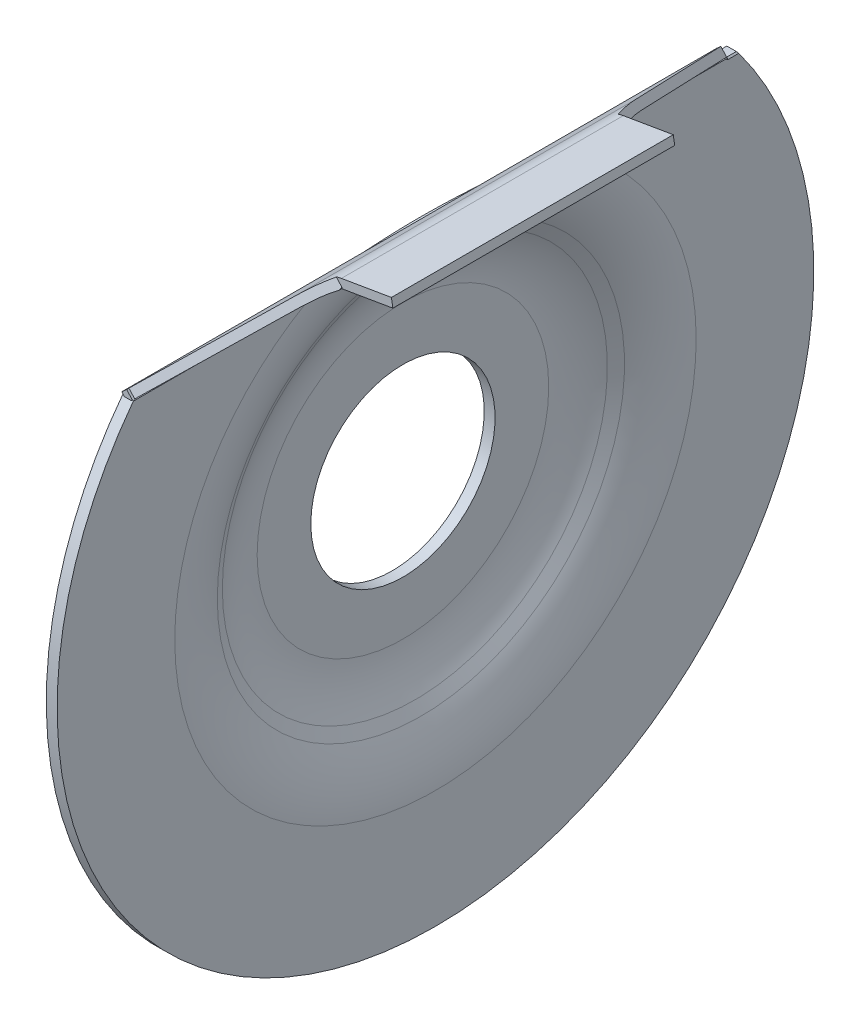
ISO-10303-21;
HEADER;
FILE_DESCRIPTION(('STEP AP214'),'2;1');
FILE_NAME('part.step','',(''),(''),'','','');
FILE_SCHEMA(('AUTOMOTIVE_DESIGN { 1 0 10303 214 1 1 1 1 }'));
ENDSEC;
DATA;
#1=APPLICATION_CONTEXT('core data for automotive mechanical design processes');
#2=APPLICATION_PROTOCOL_DEFINITION('international standard','automotive_design',2000,#1);
#3=PRODUCT_CONTEXT('',#1,'mechanical');
#4=PRODUCT('Part','Part','',(#3));
#5=PRODUCT_RELATED_PRODUCT_CATEGORY('part','',(#4));
#6=PRODUCT_DEFINITION_FORMATION('','',#4);
#7=PRODUCT_DEFINITION_CONTEXT('part definition',#1,'design');
#8=PRODUCT_DEFINITION('design','',#6,#7);
#9=PRODUCT_DEFINITION_SHAPE('','',#8);
#10=(LENGTH_UNIT() NAMED_UNIT(*) SI_UNIT(.MILLI.,.METRE.));
#11=(NAMED_UNIT(*) PLANE_ANGLE_UNIT() SI_UNIT($,.RADIAN.));
#12=(NAMED_UNIT(*) SI_UNIT($,.STERADIAN.) SOLID_ANGLE_UNIT());
#13=UNCERTAINTY_MEASURE_WITH_UNIT(LENGTH_MEASURE(1.E-05),#10,'distance_accuracy_value','');
#14=(GEOMETRIC_REPRESENTATION_CONTEXT(3) GLOBAL_UNCERTAINTY_ASSIGNED_CONTEXT((#13)) GLOBAL_UNIT_ASSIGNED_CONTEXT((#10,
#11,#12)) REPRESENTATION_CONTEXT('',''));
#15=CARTESIAN_POINT('',(0.,0.,0.));
#16=DIRECTION('',(0.,0.,1.));
#17=DIRECTION('',(1.,0.,0.));
#18=AXIS2_PLACEMENT_3D('',#15,#16,#17);
#19=CARTESIAN_POINT('',(7.44800774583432,24.2550240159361,27.8947155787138));
#20=DIRECTION('',(-0.673801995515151,0.738911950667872,0.));
#21=DIRECTION('',(-0.738911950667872,-0.673801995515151,0.));
#22=AXIS2_PLACEMENT_3D('',#19,#20,#21);
#23=PLANE('',#22);
#24=CARTESIAN_POINT('',(-19.1507960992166,0.,0.));
#25=DIRECTION('',(-0.673801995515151,0.738911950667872,0.));
#26=DIRECTION('',(-0.738911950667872,-0.673801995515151,0.));
#27=AXIS2_PLACEMENT_3D('',#24,#25,#26);
#28=ELLIPSE('',#27,51.7956317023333,34.9);
#29=CARTESIAN_POINT('',(3.94481450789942,21.0605181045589,27.829203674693));
#30=VERTEX_POINT('',#29);
#31=CARTESIAN_POINT('',(3.84957445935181,20.9736702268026,27.8947155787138));
#32=VERTEX_POINT('',#31);
#33=EDGE_CURVE('E415',#30,#32,#28,.F.);
#34=ORIENTED_EDGE('',*,*,#33,.F.);
#35=DIRECTION('',(0.,0.,1.));
#36=VECTOR('',#35,1.);
#37=CARTESIAN_POINT('',(3.94481450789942,21.0605181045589,27.8947155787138));
#38=LINE('',#37,#36);
#39=CARTESIAN_POINT('',(3.94481450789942,21.0605181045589,27.8947155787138));
#40=VERTEX_POINT('',#39);
#41=EDGE_CURVE('E237',#30,#40,#38,.T.);
#42=ORIENTED_EDGE('',*,*,#41,.T.);
#43=DIRECTION('',(-0.738911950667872,-0.673801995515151,0.));
#44=VECTOR('',#43,1.);
#45=CARTESIAN_POINT('',(7.44800774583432,24.2550240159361,27.8947155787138));
#46=LINE('',#45,#44);
#47=EDGE_CURVE('E327',#40,#32,#46,.T.);
#48=ORIENTED_EDGE('',*,*,#47,.T.);
#49=EDGE_LOOP('',(#34,#42,#48));
#50=FACE_BOUND('',#49,.T.);
#51=ADVANCED_FACE('F31',(#50),#23,.F.);
#52=CARTESIAN_POINT('',(-6.,21.,27.6848532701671));
#53=DIRECTION('',(0.,-1.,0.));
#54=DIRECTION('',(0.,0.,-1.));
#55=AXIS2_PLACEMENT_3D('',#52,#53,#54);
#56=PLANE('',#55);
#57=DIRECTION('',(1.,0.,0.));
#58=VECTOR('',#57,1.);
#59=CARTESIAN_POINT('',(-6.,21.,-26.984398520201));
#60=LINE('',#59,#58);
#61=CARTESIAN_POINT('',(3.17267339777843,21.,-26.984398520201));
#62=VERTEX_POINT('',#61);
#63=CARTESIAN_POINT('',(3.87844849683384,21.,-26.984398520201));
#64=VERTEX_POINT('',#63);
#65=EDGE_CURVE('E458',#62,#64,#60,.T.);
#66=ORIENTED_EDGE('',*,*,#65,.T.);
#67=DIRECTION('',(0.,0.,-1.));
#68=VECTOR('',#67,1.);
#69=CARTESIAN_POINT('',(3.87844849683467,21.,27.684853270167));
#70=LINE('',#69,#68);
#71=CARTESIAN_POINT('',(3.87844849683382,21.,-27.8748991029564));
#72=VERTEX_POINT('',#71);
#73=EDGE_CURVE('E469',#64,#72,#70,.T.);
#74=ORIENTED_EDGE('',*,*,#73,.T.);
#75=DIRECTION('',(-1.,0.,0.));
#76=VECTOR('',#75,1.);
#77=CARTESIAN_POINT('',(0.,21.,-27.8748991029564));
#78=LINE('',#77,#76);
#79=CARTESIAN_POINT('',(3.,21.,-27.8748991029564));
#80=VERTEX_POINT('',#79);
#81=EDGE_CURVE('E474',#72,#80,#78,.T.);
#82=ORIENTED_EDGE('',*,*,#81,.T.);
#83=DIRECTION('',(0.,0.,1.));
#84=VECTOR('',#83,1.);
#85=CARTESIAN_POINT('',(3.,21.,0.));
#86=LINE('',#85,#84);
#87=CARTESIAN_POINT('',(3.,21.,-11.7217584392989));
#88=VERTEX_POINT('',#87);
#89=EDGE_CURVE('E489',#80,#88,#86,.T.);
#90=ORIENTED_EDGE('',*,*,#89,.T.);
#91=CARTESIAN_POINT('',(2.52354267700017,21.,0.));
#92=CARTESIAN_POINT('',(2.52353854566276,21.,0.424837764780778));
#93=CARTESIAN_POINT('',(2.52770354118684,21.,0.849673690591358));
#94=CARTESIAN_POINT('',(2.54395548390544,21.,1.69919643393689));
#95=CARTESIAN_POINT('',(2.55604255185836,21.,2.12388324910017));
#96=CARTESIAN_POINT('',(2.58699313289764,21.,2.97309893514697));
#97=CARTESIAN_POINT('',(2.60585819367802,21.,3.39762774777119));
#98=CARTESIAN_POINT('',(2.64856012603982,21.,4.24642867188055));
#99=CARTESIAN_POINT('',(2.67239702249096,21.,4.67070078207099));
#100=CARTESIAN_POINT('',(2.72292948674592,21.,5.52228049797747));
#101=CARTESIAN_POINT('',(2.74964524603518,21.,5.94958688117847));
#102=CARTESIAN_POINT('',(2.80305902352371,21.,6.80419506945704));
#103=CARTESIAN_POINT('',(2.82975704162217,21.,7.23149687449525));
#104=CARTESIAN_POINT('',(2.90540717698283,21.,8.51357999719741));
#105=CARTESIAN_POINT('',(2.94992554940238,21.,9.36867855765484));
#106=CARTESIAN_POINT('',(3.00124344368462,21.,11.0563241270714));
#107=CARTESIAN_POINT('',(3.00906406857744,21.,11.8888322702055));
#108=CARTESIAN_POINT('',(2.96565117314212,21.,13.5537449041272));
#109=CARTESIAN_POINT('',(2.91437314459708,21.,14.386148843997));
#110=CARTESIAN_POINT('',(2.7753486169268,21.,15.6228032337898));
#111=CARTESIAN_POINT('',(2.71917727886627,21.,16.0306063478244));
#112=CARTESIAN_POINT('',(2.58346570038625,21.,16.8424443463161));
#113=CARTESIAN_POINT('',(2.50392217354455,21.,17.2464786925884));
#114=CARTESIAN_POINT('',(2.31879184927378,21.,18.0475727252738));
#115=CARTESIAN_POINT('',(2.21326810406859,21.,18.4446468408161));
#116=CARTESIAN_POINT('',(1.97334828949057,21.,19.2298749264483));
#117=CARTESIAN_POINT('',(1.83896774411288,21.,19.6180335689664));
#118=CARTESIAN_POINT('',(1.58650612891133,21.,20.2606037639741));
#119=CARTESIAN_POINT('',(1.47681234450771,21.,20.5183251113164));
#120=CARTESIAN_POINT('',(1.24196319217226,21.,21.026990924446));
#121=CARTESIAN_POINT('',(1.1167917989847,21.,21.2779280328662));
#122=CARTESIAN_POINT('',(0.849909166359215,21.,21.7722626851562));
#123=CARTESIAN_POINT('',(0.708129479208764,21.,22.0156233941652));
#124=CARTESIAN_POINT('',(0.40802325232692,21.,22.4919084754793));
#125=CARTESIAN_POINT('',(0.249698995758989,21.,22.7248342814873));
#126=CARTESIAN_POINT('',(-0.084755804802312,21.,23.1796895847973));
#127=CARTESIAN_POINT('',(-0.26098561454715,21.,23.4015463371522));
#128=CARTESIAN_POINT('',(-0.630400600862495,21.,23.8305440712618));
#129=CARTESIAN_POINT('',(-0.82357832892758,21.,24.0376914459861));
#130=CARTESIAN_POINT('',(-1.22639950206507,21.,24.4348348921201));
#131=CARTESIAN_POINT('',(-1.43602235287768,21.,24.6248517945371));
#132=CARTESIAN_POINT('',(-1.87124578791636,21.,24.9856091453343));
#133=CARTESIAN_POINT('',(-2.0968432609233,21.,25.1563533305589));
#134=CARTESIAN_POINT('',(-2.52570458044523,21.,25.450640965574));
#135=CARTESIAN_POINT('',(-2.72678757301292,21.,25.5773685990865));
#136=CARTESIAN_POINT('',(-3.13854209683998,21.,25.814122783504));
#137=CARTESIAN_POINT('',(-3.34921200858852,21.,25.9241521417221));
#138=CARTESIAN_POINT('',(-3.77900148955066,21.,26.1262024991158));
#139=CARTESIAN_POINT('',(-3.99812001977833,21.,26.2182257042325));
#140=CARTESIAN_POINT('',(-4.44347238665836,21.,26.3831079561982));
#141=CARTESIAN_POINT('',(-4.66970634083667,21.,26.4559666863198));
#142=CARTESIAN_POINT('',(-5.12855184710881,21.,26.5817617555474));
#143=CARTESIAN_POINT('',(-5.36118374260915,21.,26.6346240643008));
#144=CARTESIAN_POINT('',(-5.83025793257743,21.,26.7192946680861));
#145=CARTESIAN_POINT('',(-6.06670024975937,21.,26.7511028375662));
#146=CARTESIAN_POINT('',(-6.54146480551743,21.,26.7931953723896));
#147=CARTESIAN_POINT('',(-6.77978679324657,21.,26.8034825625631));
#148=CARTESIAN_POINT('',(-7.2563737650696,21.,26.8023869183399));
#149=CARTESIAN_POINT('',(-7.49463875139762,21.,26.7910051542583));
#150=CARTESIAN_POINT('',(-7.9538070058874,21.,26.748178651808));
#151=CARTESIAN_POINT('',(-8.17483705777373,21.,26.7180782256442));
#152=CARTESIAN_POINT('',(-8.61359947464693,21.,26.6394593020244));
#153=CARTESIAN_POINT('',(-8.83133177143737,21.,26.5909404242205));
#154=CARTESIAN_POINT('',(-9.26202167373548,21.,26.4760935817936));
#155=CARTESIAN_POINT('',(-9.47497960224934,21.,26.4097668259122));
#156=CARTESIAN_POINT('',(-9.89482374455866,21.,26.2600961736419));
#157=CARTESIAN_POINT('',(-10.1017097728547,21.,26.1767517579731));
#158=CARTESIAN_POINT('',(-10.5123448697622,21.,25.9921509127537));
#159=CARTESIAN_POINT('',(-10.7159466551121,21.,25.8905673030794));
#160=CARTESIAN_POINT('',(-11.1146512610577,21.,25.6717640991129));
#161=CARTESIAN_POINT('',(-11.3097507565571,21.,25.5545384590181));
#162=CARTESIAN_POINT('',(-11.6904770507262,21.,25.3057211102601));
#163=CARTESIAN_POINT('',(-11.8761061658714,21.,25.1741329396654));
#164=CARTESIAN_POINT('',(-12.2373109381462,21.,24.897804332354));
#165=CARTESIAN_POINT('',(-12.4128854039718,21.,24.7530623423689));
#166=CARTESIAN_POINT('',(-12.7723261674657,21.,24.4350269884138));
#167=CARTESIAN_POINT('',(-12.9549647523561,21.,24.2603460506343));
#168=CARTESIAN_POINT('',(-13.3068486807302,21.,23.8980050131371));
#169=CARTESIAN_POINT('',(-13.4760934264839,21.,23.7103443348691));
#170=CARTESIAN_POINT('',(-13.8011795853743,21.,23.3234659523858));
#171=CARTESIAN_POINT('',(-13.9570080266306,21.,23.124237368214));
#172=CARTESIAN_POINT('',(-14.2551279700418,21.,22.7158784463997));
#173=CARTESIAN_POINT('',(-14.3974165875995,21.,22.5067460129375));
#174=CARTESIAN_POINT('',(-14.7439614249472,21.,21.9614278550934));
#175=CARTESIAN_POINT('',(-14.9387447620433,21.,21.6191854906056));
#176=CARTESIAN_POINT('',(-15.2972606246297,21.,20.9187875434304));
#177=CARTESIAN_POINT('',(-15.4609792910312,21.,20.5606249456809));
#178=CARTESIAN_POINT('',(-15.7590997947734,21.,19.8325425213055));
#179=CARTESIAN_POINT('',(-15.8935131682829,21.,19.4626273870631));
#180=CARTESIAN_POINT('',(-16.1353352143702,21.,18.7139984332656));
#181=CARTESIAN_POINT('',(-16.2427340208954,21.,18.3352814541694));
#182=CARTESIAN_POINT('',(-16.4177373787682,21.,17.6325370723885));
#183=CARTESIAN_POINT('',(-16.4889547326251,21.,17.3093961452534));
#184=CARTESIAN_POINT('',(-16.6154365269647,21.,16.6601037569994));
#185=CARTESIAN_POINT('',(-16.6707040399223,21.,16.3339528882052));
#186=CARTESIAN_POINT('',(-16.814945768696,21.,15.3519557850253));
#187=CARTESIAN_POINT('',(-16.8822798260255,21.,14.6928983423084));
#188=CARTESIAN_POINT('',(-16.9717277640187,21.,13.3688820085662));
#189=CARTESIAN_POINT('',(-16.9936178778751,21.,12.7039100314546));
#190=CARTESIAN_POINT('',(-17.0039439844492,21.,11.3738261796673));
#191=CARTESIAN_POINT('',(-16.9923772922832,21.,10.7087142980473));
#192=CARTESIAN_POINT('',(-16.9438652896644,21.,9.25542425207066));
#193=CARTESIAN_POINT('',(-16.9025907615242,21.,8.46741894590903));
#194=CARTESIAN_POINT('',(-16.8330077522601,21.,7.28583820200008));
#195=CARTESIAN_POINT('',(-16.8085311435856,21.,6.89199721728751));
#196=CARTESIAN_POINT('',(-16.7593301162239,21.,6.10433012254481));
#197=CARTESIAN_POINT('',(-16.7346057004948,21.,5.71050401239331));
#198=CARTESIAN_POINT('',(-16.6871016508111,21.,4.92319577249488));
#199=CARTESIAN_POINT('',(-16.6643197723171,21.,4.52971378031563));
#200=CARTESIAN_POINT('',(-16.6225748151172,21.,3.74254273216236));
#201=CARTESIAN_POINT('',(-16.6036117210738,21.,3.34885367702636));
#202=CARTESIAN_POINT('',(-16.5710723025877,21.,2.561353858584));
#203=CARTESIAN_POINT('',(-16.557494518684,21.,2.16754315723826));
#204=CARTESIAN_POINT('',(-16.5368341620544,21.,1.37974849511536));
#205=CARTESIAN_POINT('',(-16.5297515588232,21.,0.985764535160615));
#206=CARTESIAN_POINT('',(-16.5226563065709,21.,0.196790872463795));
#207=CARTESIAN_POINT('',(-16.5226605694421,21.,-0.198198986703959));
#208=CARTESIAN_POINT('',(-16.5297811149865,21.,-0.988113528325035));
#209=CARTESIAN_POINT('',(-16.5368974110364,21.,-1.38303821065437));
#210=CARTESIAN_POINT('',(-16.5576555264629,21.,-2.1727945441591));
#211=CARTESIAN_POINT('',(-16.5712987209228,21.,-2.5676261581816));
#212=CARTESIAN_POINT('',(-16.6039842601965,21.,-3.35706169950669));
#213=CARTESIAN_POINT('',(-16.6230266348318,21.,-3.75166562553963));
#214=CARTESIAN_POINT('',(-16.6649629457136,21.,-4.54122179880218));
#215=CARTESIAN_POINT('',(-16.6878622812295,21.,-4.93617375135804));
#216=CARTESIAN_POINT('',(-16.7355615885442,21.,-5.72596033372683));
#217=CARTESIAN_POINT('',(-16.7603615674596,21.,-6.1207949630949));
#218=CARTESIAN_POINT('',(-16.8096801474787,21.,-6.9104405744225));
#219=CARTESIAN_POINT('',(-16.8341987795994,21.,-7.30525155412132));
#220=CARTESIAN_POINT('',(-16.880610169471,21.,-8.09502539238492));
#221=CARTESIAN_POINT('',(-16.9025029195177,21.,-8.48998825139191));
#222=CARTESIAN_POINT('',(-16.9611118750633,21.,-9.68600462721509));
#223=CARTESIAN_POINT('',(-16.9899591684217,21.,-10.4875118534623));
#224=CARTESIAN_POINT('',(-17.0057248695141,21.,-12.0912937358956));
#225=CARTESIAN_POINT('',(-16.9926457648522,21.,-12.8935683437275));
#226=CARTESIAN_POINT('',(-16.9033630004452,21.,-14.4869735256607));
#227=CARTESIAN_POINT('',(-16.8277947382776,21.,-15.2781350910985));
#228=CARTESIAN_POINT('',(-16.5930509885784,21.,-16.8479677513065));
#229=CARTESIAN_POINT('',(-16.4340030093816,21.,-17.6266560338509));
#230=CARTESIAN_POINT('',(-16.1382701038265,21.,-18.6979621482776));
#231=CARTESIAN_POINT('',(-16.0450880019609,21.,-19.0027887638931));
#232=CARTESIAN_POINT('',(-15.8406854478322,21.,-19.6063710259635));
#233=CARTESIAN_POINT('',(-15.7294663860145,21.,-19.9051271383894));
#234=CARTESIAN_POINT('',(-15.4874345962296,21.,-20.4957987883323));
#235=CARTESIAN_POINT('',(-15.3565574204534,21.,-20.7876880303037));
#236=CARTESIAN_POINT('',(-15.0744945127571,21.,-21.3614716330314));
#237=CARTESIAN_POINT('',(-14.9233122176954,21.,-21.6433676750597));
#238=CARTESIAN_POINT('',(-14.598338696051,21.,-22.1973501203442));
#239=CARTESIAN_POINT('',(-14.4243530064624,21.,-22.4693229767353));
#240=CARTESIAN_POINT('',(-14.0544364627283,21.,-22.9977771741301));
#241=CARTESIAN_POINT('',(-13.8585167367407,21.,-23.2542662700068));
#242=CARTESIAN_POINT('',(-13.444932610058,21.,-23.7483318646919));
#243=CARTESIAN_POINT('',(-13.2273089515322,21.,-23.9859423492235));
#244=CARTESIAN_POINT('',(-12.7704419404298,21.,-24.4393699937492));
#245=CARTESIAN_POINT('',(-12.531205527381,21.,-24.6551941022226));
#246=CARTESIAN_POINT('',(-12.0925040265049,21.,-25.0124131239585));
#247=CARTESIAN_POINT('',(-11.8974032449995,21.,-25.1591889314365));
#248=CARTESIAN_POINT('',(-11.4960993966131,21.,-25.4366530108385));
#249=CARTESIAN_POINT('',(-11.289898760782,21.,-25.5673447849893));
#250=CARTESIAN_POINT('',(-10.8673360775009,21.,-25.8111498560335));
#251=CARTESIAN_POINT('',(-10.6509740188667,21.,-25.9242631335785));
#252=CARTESIAN_POINT('',(-10.2093083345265,21.,-26.1314945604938));
#253=CARTESIAN_POINT('',(-9.98400445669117,21.,-26.2256121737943));
#254=CARTESIAN_POINT('',(-9.52486647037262,21.,-26.3939717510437));
#255=CARTESIAN_POINT('',(-9.29099718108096,21.,-26.4681180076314));
#256=CARTESIAN_POINT('',(-8.81747848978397,21.,-26.5948757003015));
#257=CARTESIAN_POINT('',(-8.57782905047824,21.,-26.6474869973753));
#258=CARTESIAN_POINT('',(-8.09475941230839,21.,-26.7303676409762));
#259=CARTESIAN_POINT('',(-7.85134028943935,21.,-26.7606432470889));
#260=CARTESIAN_POINT('',(-7.36274730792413,21.,-26.7984029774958));
#261=CARTESIAN_POINT('',(-7.11757357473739,21.,-26.8058887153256));
#262=CARTESIAN_POINT('',(-6.64762041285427,21.,-26.7982838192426));
#263=CARTESIAN_POINT('',(-6.42280994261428,21.,-26.7849862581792));
#264=CARTESIAN_POINT('',(-5.97514206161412,21.,-26.7392572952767));
#265=CARTESIAN_POINT('',(-5.7522846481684,21.,-26.7068259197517));
#266=CARTESIAN_POINT('',(-5.31014766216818,21.,-26.6232576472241));
#267=CARTESIAN_POINT('',(-5.0908675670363,21.,-26.572123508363));
#268=CARTESIAN_POINT('',(-4.65732422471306,21.,-26.4517954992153));
#269=CARTESIAN_POINT('',(-4.44306108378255,21.,-26.3826012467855));
#270=CARTESIAN_POINT('',(-4.0213001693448,21.,-26.2271431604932));
#271=CARTESIAN_POINT('',(-3.81379018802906,21.,-26.1409123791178));
#272=CARTESIAN_POINT('',(-3.40618825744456,21.,-25.9522495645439));
#273=CARTESIAN_POINT('',(-3.20609920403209,21.,-25.849811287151));
#274=CARTESIAN_POINT('',(-2.81442877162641,21.,-25.6298720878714));
#275=CARTESIAN_POINT('',(-2.62284627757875,21.,-25.5123731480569));
#276=CARTESIAN_POINT('',(-2.24893499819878,21.,-25.2634636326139));
#277=CARTESIAN_POINT('',(-2.06660723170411,21.,-25.1320515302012));
#278=CARTESIAN_POINT('',(-1.69548430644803,21.,-24.843832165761));
#279=CARTESIAN_POINT('',(-1.50764002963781,21.,-24.6858007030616));
#280=CARTESIAN_POINT('',(-1.14429188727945,21.,-24.3561648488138));
#281=CARTESIAN_POINT('',(-0.968788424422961,21.,-24.1845600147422));
#282=CARTESIAN_POINT('',(-0.630381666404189,21.,-23.8292394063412));
#283=CARTESIAN_POINT('',(-0.467483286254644,21.,-23.6455189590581));
#284=CARTESIAN_POINT('',(-0.154472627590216,21.,-23.267475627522));
#285=CARTESIAN_POINT('',(-0.00436286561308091,21.,-23.073150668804));
#286=CARTESIAN_POINT('',(0.355127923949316,21.,-22.5755617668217));
#287=CARTESIAN_POINT('',(0.556524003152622,21.,-22.2664971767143));
#288=CARTESIAN_POINT('',(0.931248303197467,21.,-21.631781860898));
#289=CARTESIAN_POINT('',(1.10456515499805,21.,-21.3061244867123));
#290=CARTESIAN_POINT('',(1.42456203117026,21.,-20.6414291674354));
#291=CARTESIAN_POINT('',(1.57120143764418,21.,-20.3023717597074));
#292=CARTESIAN_POINT('',(1.83911212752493,21.,-19.6144891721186));
#293=CARTESIAN_POINT('',(1.96038428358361,21.,-19.2656643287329));
#294=CARTESIAN_POINT('',(2.24266406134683,21.,-18.357251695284));
#295=CARTESIAN_POINT('',(2.38621086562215,21.,-17.7922127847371));
#296=CARTESIAN_POINT('',(2.62280579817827,21.,-16.6516200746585));
#297=CARTESIAN_POINT('',(2.71581676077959,21.,-16.0760588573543));
#298=CARTESIAN_POINT('',(2.85968087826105,21.,-14.9190826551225));
#299=CARTESIAN_POINT('',(2.91047656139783,21.,-14.337660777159));
#300=CARTESIAN_POINT('',(2.97810012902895,21.,-13.1732745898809));
#301=CARTESIAN_POINT('',(2.99494298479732,21.,-12.590311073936));
#302=CARTESIAN_POINT('',(3.00598271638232,21.,-11.0091378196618));
#303=CARTESIAN_POINT('',(2.9755089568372,21.,-10.0108766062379));
#304=CARTESIAN_POINT('',(2.90433082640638,21.,-8.51455671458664));
#305=CARTESIAN_POINT('',(2.87633289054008,21.,-8.01562818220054));
#306=CARTESIAN_POINT('',(2.81674684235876,21.,-7.01797849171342));
#307=CARTESIAN_POINT('',(2.7851588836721,21.,-6.51925732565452));
#308=CARTESIAN_POINT('',(2.72285361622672,21.,-5.51864862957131));
#309=CARTESIAN_POINT('',(2.69214295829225,21.,-5.01676073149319));
#310=CARTESIAN_POINT('',(2.63602080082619,21.,-4.01266557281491));
#311=CARTESIAN_POINT('',(2.61060936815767,21.,-3.51045830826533));
#312=CARTESIAN_POINT('',(2.56853872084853,21.,-2.50698332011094));
#313=CARTESIAN_POINT('',(2.55185669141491,21.,-2.00571659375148));
#314=CARTESIAN_POINT('',(2.5293615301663,21.,-1.00296571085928));
#315=CARTESIAN_POINT('',(2.52354755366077,21.,-0.501481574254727));
#316=CARTESIAN_POINT('',(2.52354267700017,21.,0.));
#317=B_SPLINE_CURVE_WITH_KNOTS('',3,(#91,#92,#93,#94,#95,#96,#97,#98,#99,#100,#101,#102,#103,
#104,#105,#106,#107,#108,#109,#110,#111,#112,#113,#114,#115,#116,#117,#118,#119,#120,#121,#122,
#123,#124,#125,#126,#127,#128,#129,#130,#131,#132,#133,#134,#135,#136,#137,#138,#139,#140,#141,
#142,#143,#144,#145,#146,#147,#148,#149,#150,#151,#152,#153,#154,#155,#156,#157,#158,#159,#160,
#161,#162,#163,#164,#165,#166,#167,#168,#169,#170,#171,#172,#173,#174,#175,#176,#177,#178,#179,
#180,#181,#182,#183,#184,#185,#186,#187,#188,#189,#190,#191,#192,#193,#194,#195,#196,#197,#198,
#199,#200,#201,#202,#203,#204,#205,#206,#207,#208,#209,#210,#211,#212,#213,#214,#215,#216,#217,
#218,#219,#220,#221,#222,#223,#224,#225,#226,#227,#228,#229,#230,#231,#232,#233,#234,#235,#236,
#237,#238,#239,#240,#241,#242,#243,#244,#245,#246,#247,#248,#249,#250,#251,#252,#253,#254,#255,
#256,#257,#258,#259,#260,#261,#262,#263,#264,#265,#266,#267,#268,#269,#270,#271,#272,#273,#274,
#275,#276,#277,#278,#279,#280,#281,#282,#283,#284,#285,#286,#287,#288,#289,#290,#291,#292,#293,
#294,#295,#296,#297,#298,#299,#300,#301,#302,#303,#304,#305,#306,#307,#308,#309,#310,#311,#312,
#313,#314,#315,#316),.UNSPECIFIED.,.T.,.F.,(4,2,2,2,2,2,2,2,2,2,2,2,2,2,2,2,2,2,2,2,2,2,2,2,2,2,
2,2,2,2,2,2,2,2,2,2,2,2,2,2,2,2,2,2,2,2,2,2,2,2,2,2,2,2,2,2,2,2,2,2,2,2,2,2,2,2,2,2,2,2,2,2,2,2,
2,2,2,2,2,2,2,2,2,2,2,2,2,2,2,2,2,2,2,2,2,2,2,2,2,2,2,2,2,2,2,2,2,2,2,2,2,2,4),(0.,
1.2744910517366,2.54900153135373,3.82380321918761,5.09861128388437,6.3830274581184,
7.66745086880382,10.2358779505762,12.7323979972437,15.2307994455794,16.4652050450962,
17.699784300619,18.9313963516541,20.1623474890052,21.0021869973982,21.8429034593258,
22.6872154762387,23.5314111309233,24.3805727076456,25.2293629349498,26.0771066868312,
26.924685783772,27.6370109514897,28.3492162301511,29.061334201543,29.7734639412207,
30.4882048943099,31.2029501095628,31.9176015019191,32.6322175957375,33.3006447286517,
33.9690856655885,34.6374812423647,35.3058972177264,35.9877860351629,36.6699391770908,
37.351924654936,38.0339907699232,38.7914285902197,39.5489001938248,40.3070961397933,
41.0654532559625,42.244986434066,43.4250446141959,44.6046374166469,45.7846603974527,
46.7769202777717,47.7689888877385,49.7541499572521,51.7490630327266,53.744136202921,
56.1111409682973,57.2949558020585,58.4787565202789,59.6611703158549,60.8435793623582,
62.0256677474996,63.2077505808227,64.3926543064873,65.57756026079,66.7627159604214,
67.9478782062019,69.1347135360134,70.3215533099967,71.5082609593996,72.6949720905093,
75.1005017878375,77.5058887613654,79.8871139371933,82.2647125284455,83.2205108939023,
84.1762356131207,85.1351649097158,86.0939321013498,87.0614840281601,88.0285472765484,
88.9938281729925,89.958800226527,90.6905244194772,91.4220889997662,92.1536543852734,
92.8852404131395,93.6202723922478,94.3553091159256,95.0901397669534,95.824918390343,
96.4997155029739,97.1745116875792,97.8492083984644,98.52391938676,99.1973340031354,
99.8710086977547,100.544594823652,101.218254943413,101.953957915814,102.689684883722,
103.425697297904,104.161854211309,105.266843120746,106.372278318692,107.479382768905,
108.586449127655,110.332438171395,112.079709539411,113.829355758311,115.578230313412,
118.572615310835,120.071817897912,121.570956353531,123.079435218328,124.587933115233,
126.092468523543,127.596886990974),.UNSPECIFIED.);
#318=CARTESIAN_POINT('',(3.00000000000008,21.,11.7217584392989));
#319=VERTEX_POINT('',#318);
#320=EDGE_CURVE('E423',#88,#319,#317,.T.);
#321=ORIENTED_EDGE('',*,*,#320,.T.);
#322=CARTESIAN_POINT('',(3.,21.,27.6848532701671));
#323=VERTEX_POINT('',#322);
#324=EDGE_CURVE('E428',#319,#323,#86,.T.);
#325=ORIENTED_EDGE('',*,*,#324,.T.);
#326=DIRECTION('',(1.,0.,0.));
#327=VECTOR('',#326,1.);
#328=CARTESIAN_POINT('',(-6.,21.,27.6848532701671));
#329=LINE('',#328,#327);
#330=CARTESIAN_POINT('',(3.17267339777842,21.,27.6848532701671));
#331=VERTEX_POINT('',#330);
#332=EDGE_CURVE('E420',#323,#331,#329,.T.);
#333=ORIENTED_EDGE('',*,*,#332,.T.);
#334=DIRECTION('',(0.,0.,1.));
#335=VECTOR('',#334,1.);
#336=CARTESIAN_POINT('',(3.17267339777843,21.,27.6848532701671));
#337=LINE('',#336,#335);
#338=EDGE_CURVE('E334',#62,#331,#337,.T.);
#339=ORIENTED_EDGE('',*,*,#338,.F.);
#340=EDGE_LOOP('',(#66,#74,#82,#90,#321,#325,#333,#339));
#341=FACE_BOUND('',#340,.T.);
#342=ADVANCED_FACE('F379',(#341),#56,.F.);
#343=CARTESIAN_POINT('',(8.32597700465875,25.5369838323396,-26.984398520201));
#344=DIRECTION('',(0.,0.,-1.));
#345=DIRECTION('',(-1.,0.,0.));
#346=AXIS2_PLACEMENT_3D('',#343,#344,#345);
#347=PLANE('',#346);
#348=DIRECTION('',(0.673801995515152,-0.738911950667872,0.));
#349=VECTOR('',#348,1.);
#350=CARTESIAN_POINT('',(0.50943851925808,24.6945597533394,-26.984398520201));
#351=LINE('',#350,#349);
#352=CARTESIAN_POINT('',(3.33940690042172,21.5911295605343,-26.984398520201));
#353=VERTEX_POINT('',#352);
#354=EDGE_CURVE('E249',#353,#64,#351,.T.);
#355=ORIENTED_EDGE('',*,*,#354,.T.);
#356=ORIENTED_EDGE('',*,*,#65,.F.);
#357=DIRECTION('',(-0.673801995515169,0.738911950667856,0.));
#358=VECTOR('',#357,1.);
#359=CARTESIAN_POINT('',(2.9540601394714,21.2397380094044,-26.984398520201));
#360=LINE('',#359,#358);
#361=CARTESIAN_POINT('',(2.9540601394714,21.2397380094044,-26.984398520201));
#362=VERTEX_POINT('',#361);
#363=EDGE_CURVE('E321',#62,#362,#360,.T.);
#364=ORIENTED_EDGE('',*,*,#363,.T.);
#365=DIRECTION('',(-0.738911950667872,-0.673801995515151,0.));
#366=VECTOR('',#365,1.);
#367=CARTESIAN_POINT('',(6.90896614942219,24.8461535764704,-26.984398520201));
#368=LINE('',#367,#366);
#369=EDGE_CURVE('E330',#353,#362,#368,.T.);
#370=ORIENTED_EDGE('',*,*,#369,.F.);
#371=EDGE_LOOP('',(#355,#356,#364,#370));
#372=FACE_BOUND('',#371,.T.);
#373=ADVANCED_FACE('F375',(#372),#347,.T.);
#374=CARTESIAN_POINT('',(8.79330893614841,22.7797254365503,0.));
#375=DIRECTION('',(0.,0.,1.));
#376=DIRECTION('',(1.,0.,0.));
#377=AXIS2_PLACEMENT_3D('',#374,#375,#376);
#378=CYLINDRICAL_SURFACE('',#377,1.99658237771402);
#379=DIRECTION('',(0.,0.,1.));
#380=VECTOR('',#379,1.);
#381=CARTESIAN_POINT('',(8.36093459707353,24.7289287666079,0.));
#382=LINE('',#381,#380);
#383=CARTESIAN_POINT('',(8.36093459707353,24.7289287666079,13.2168576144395));
#384=VERTEX_POINT('',#383);
#385=CARTESIAN_POINT('',(8.36093459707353,24.7289287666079,13.));
#386=VERTEX_POINT('',#385);
#387=EDGE_CURVE('E295',#384,#386,#382,.F.);
#388=ORIENTED_EDGE('',*,*,#387,.F.);
#389=CARTESIAN_POINT('',(8.79330893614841,22.7797254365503,15.7242401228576));
#390=DIRECTION('',(-0.686915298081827,-0.626387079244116,-0.36849233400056));
#391=DIRECTION('',(-0.272283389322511,-0.248290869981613,0.929630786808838));
#392=AXIS2_PLACEMENT_3D('',#389,#390,#391);
#393=ELLIPSE('',#392,5.41824671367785,1.99658237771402);
#394=CARTESIAN_POINT('',(7.44800774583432,24.2550240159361,15.7242401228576));
#395=VERTEX_POINT('',#394);
#396=EDGE_CURVE('E46',#384,#395,#393,.F.);
#397=ORIENTED_EDGE('',*,*,#396,.T.);
#398=DIRECTION('',(0.,0.,-1.));
#399=VECTOR('',#398,1.);
#400=CARTESIAN_POINT('',(7.44800774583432,24.2550240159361,27.8947155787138));
#401=LINE('',#400,#399);
#402=CARTESIAN_POINT('',(7.44800774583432,24.2550240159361,-15.5548745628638));
#403=VERTEX_POINT('',#402);
#404=EDGE_CURVE('E308',#395,#403,#401,.T.);
#405=ORIENTED_EDGE('',*,*,#404,.T.);
#406=CARTESIAN_POINT('',(8.79330893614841,22.7797254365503,-15.5548745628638));
#407=DIRECTION('',(-0.680614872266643,-0.620641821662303,0.389316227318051));
#408=DIRECTION('',(0.287670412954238,0.262322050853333,0.921104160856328));
#409=AXIS2_PLACEMENT_3D('',#406,#407,#408);
#410=ELLIPSE('',#409,5.1284334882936,1.99658237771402);
#411=CARTESIAN_POINT('',(8.36093459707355,24.7289287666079,-13.2033756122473));
#412=VERTEX_POINT('',#411);
#413=EDGE_CURVE('E253',#403,#412,#410,.F.);
#414=ORIENTED_EDGE('',*,*,#413,.T.);
#415=DIRECTION('',(0.,0.,1.));
#416=VECTOR('',#415,1.);
#417=CARTESIAN_POINT('',(8.36093459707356,24.7289287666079,0.));
#418=LINE('',#417,#416);
#419=CARTESIAN_POINT('',(8.36093459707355,24.7289287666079,-13.));
#420=VERTEX_POINT('',#419);
#421=EDGE_CURVE('E298',#420,#412,#418,.F.);
#422=ORIENTED_EDGE('',*,*,#421,.F.);
#423=CARTESIAN_POINT('',(8.79330893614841,22.7797254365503,-13.));
#424=DIRECTION('',(0.,0.,-1.));
#425=DIRECTION('',(-1.,0.,0.));
#426=AXIS2_PLACEMENT_3D('',#423,#424,#425);
#427=CIRCLE('',#426,1.99658237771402);
#428=CARTESIAN_POINT('',(8.45966358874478,24.7482329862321,-13.));
#429=VERTEX_POINT('',#428);
#430=EDGE_CURVE('E292',#429,#420,#427,.F.);
#431=ORIENTED_EDGE('',*,*,#430,.F.);
#432=DIRECTION('',(0.,0.,-1.));
#433=VECTOR('',#432,1.);
#434=CARTESIAN_POINT('',(8.45966358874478,24.7482329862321,27.8947155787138));
#435=LINE('',#434,#433);
#436=CARTESIAN_POINT('',(8.45966358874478,24.7482329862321,13.));
#437=VERTEX_POINT('',#436);
#438=EDGE_CURVE('E302',#437,#429,#435,.T.);
#439=ORIENTED_EDGE('',*,*,#438,.F.);
#440=CARTESIAN_POINT('',(8.79330893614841,22.7797254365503,13.));
#441=DIRECTION('',(0.,0.,1.));
#442=DIRECTION('',(1.,0.,0.));
#443=AXIS2_PLACEMENT_3D('',#440,#441,#442);
#444=CIRCLE('',#443,1.99658237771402);
#445=EDGE_CURVE('E286',#386,#437,#444,.F.);
#446=ORIENTED_EDGE('',*,*,#445,.F.);
#447=EDGE_LOOP('',(#388,#397,#405,#414,#422,#431,#439,#446));
#448=FACE_BOUND('',#447,.T.);
#449=ADVANCED_FACE('F378',(#448),#378,.F.);
#450=CARTESIAN_POINT('',(8.32597700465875,25.5369838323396,27.8947155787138));
#451=DIRECTION('',(0.,0.,1.));
#452=DIRECTION('',(1.,0.,0.));
#453=AXIS2_PLACEMENT_3D('',#450,#451,#452);
#454=PLANE('',#453);
#455=DIRECTION('',(0.673801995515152,-0.738911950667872,0.));
#456=VECTOR('',#455,1.);
#457=CARTESIAN_POINT('',(3.70515796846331,21.323332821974,27.8947155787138));
#458=LINE('',#457,#456);
#459=CARTESIAN_POINT('',(3.40577291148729,21.6516476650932,27.8947155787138));
#460=VERTEX_POINT('',#459);
#461=EDGE_CURVE('E215',#460,#40,#458,.T.);
#462=ORIENTED_EDGE('',*,*,#461,.F.);
#463=DIRECTION('',(-0.738911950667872,-0.673801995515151,0.));
#464=VECTOR('',#463,1.);
#465=CARTESIAN_POINT('',(6.90896614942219,24.8461535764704,27.8947155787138));
#466=LINE('',#465,#464);
#467=CARTESIAN_POINT('',(2.9540601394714,21.2397380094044,27.8947155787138));
#468=VERTEX_POINT('',#467);
#469=EDGE_CURVE('E332',#460,#468,#466,.T.);
#470=ORIENTED_EDGE('',*,*,#469,.T.);
#471=DIRECTION('',(0.673801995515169,-0.738911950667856,0.));
#472=VECTOR('',#471,1.);
#473=CARTESIAN_POINT('',(2.9540601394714,21.2397380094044,27.8947155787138));
#474=LINE('',#473,#472);
#475=CARTESIAN_POINT('',(3.19668309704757,20.9736702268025,27.8947155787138));
#476=VERTEX_POINT('',#475);
#477=EDGE_CURVE('E315',#468,#476,#474,.T.);
#478=ORIENTED_EDGE('',*,*,#477,.T.);
#479=DIRECTION('',(-1.,0.,0.));
#480=VECTOR('',#479,1.);
#481=CARTESIAN_POINT('',(0.,20.9736702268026,27.8947155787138));
#482=LINE('',#481,#480);
#483=EDGE_CURVE('E461',#476,#32,#482,.F.);
#484=ORIENTED_EDGE('',*,*,#483,.T.);
#485=ORIENTED_EDGE('',*,*,#47,.F.);
#486=EDGE_LOOP('',(#462,#470,#478,#484,#485));
#487=FACE_BOUND('',#486,.T.);
#488=ADVANCED_FACE('F373',(#487),#454,.T.);
#489=CARTESIAN_POINT('',(8.32597700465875,25.5369838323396,27.8947155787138));
#490=DIRECTION('',(-0.167108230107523,0.985938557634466,0.));
#491=DIRECTION('',(-0.985938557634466,-0.167108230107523,0.));
#492=AXIS2_PLACEMENT_3D('',#489,#490,#491);
#493=PLANE('',#492);
#494=DIRECTION('',(0.,0.,1.));
#495=VECTOR('',#494,1.);
#496=CARTESIAN_POINT('',(8.32597700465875,25.5369838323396,27.8947155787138));
#497=LINE('',#496,#495);
#498=CARTESIAN_POINT('',(8.32597700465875,25.5369838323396,-13.));
#499=VERTEX_POINT('',#498);
#500=CARTESIAN_POINT('',(8.32597700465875,25.5369838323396,13.));
#501=VERTEX_POINT('',#500);
#502=EDGE_CURVE('E305',#499,#501,#497,.T.);
#503=ORIENTED_EDGE('',*,*,#502,.T.);
#504=DIRECTION('',(0.985938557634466,0.167108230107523,0.));
#505=VECTOR('',#504,1.);
#506=CARTESIAN_POINT('',(8.32597700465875,25.5369838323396,13.));
#507=LINE('',#506,#505);
#508=CARTESIAN_POINT('',(12.9352509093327,26.3182166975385,13.));
#509=VERTEX_POINT('',#508);
#510=EDGE_CURVE('E210',#501,#509,#507,.T.);
#511=ORIENTED_EDGE('',*,*,#510,.T.);
#512=DIRECTION('',(0.,0.,1.));
#513=VECTOR('',#512,1.);
#514=CARTESIAN_POINT('',(12.9352509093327,26.3182166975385,27.8947155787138));
#515=LINE('',#514,#513);
#516=CARTESIAN_POINT('',(12.9352509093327,26.3182166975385,-13.));
#517=VERTEX_POINT('',#516);
#518=EDGE_CURVE('E306',#517,#509,#515,.T.);
#519=ORIENTED_EDGE('',*,*,#518,.F.);
#520=DIRECTION('',(-0.985938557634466,-0.167108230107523,0.));
#521=VECTOR('',#520,1.);
#522=CARTESIAN_POINT('',(8.32597700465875,25.5369838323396,-13.));
#523=LINE('',#522,#521);
#524=EDGE_CURVE('E54',#517,#499,#523,.T.);
#525=ORIENTED_EDGE('',*,*,#524,.T.);
#526=EDGE_LOOP('',(#503,#511,#519,#525));
#527=FACE_BOUND('',#526,.T.);
#528=ADVANCED_FACE('F370',(#527),#493,.T.);
#529=CARTESIAN_POINT('',(8.45966358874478,24.7482329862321,27.8947155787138));
#530=DIRECTION('',(0.167108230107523,-0.985938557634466,0.));
#531=DIRECTION('',(0.985938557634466,0.167108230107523,0.));
#532=AXIS2_PLACEMENT_3D('',#529,#530,#531);
#533=PLANE('',#532);
#534=ORIENTED_EDGE('',*,*,#438,.T.);
#535=DIRECTION('',(0.985938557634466,0.167108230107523,0.));
#536=VECTOR('',#535,1.);
#537=CARTESIAN_POINT('',(8.45966358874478,24.7482329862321,-13.));
#538=LINE('',#537,#536);
#539=CARTESIAN_POINT('',(13.0689374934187,25.529465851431,-13.));
#540=VERTEX_POINT('',#539);
#541=EDGE_CURVE('E288',#429,#540,#538,.T.);
#542=ORIENTED_EDGE('',*,*,#541,.T.);
#543=DIRECTION('',(0.,0.,-1.));
#544=VECTOR('',#543,1.);
#545=CARTESIAN_POINT('',(13.0689374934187,25.529465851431,27.8947155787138));
#546=LINE('',#545,#544);
#547=CARTESIAN_POINT('',(13.0689374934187,25.529465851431,13.));
#548=VERTEX_POINT('',#547);
#549=EDGE_CURVE('E301',#548,#540,#546,.T.);
#550=ORIENTED_EDGE('',*,*,#549,.F.);
#551=DIRECTION('',(-0.985938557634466,-0.167108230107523,0.));
#552=VECTOR('',#551,1.);
#553=CARTESIAN_POINT('',(8.45966358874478,24.7482329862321,13.));
#554=LINE('',#553,#552);
#555=EDGE_CURVE('E282',#548,#437,#554,.T.);
#556=ORIENTED_EDGE('',*,*,#555,.T.);
#557=EDGE_LOOP('',(#534,#542,#550,#556));
#558=FACE_BOUND('',#557,.T.);
#559=ADVANCED_FACE('F368',(#558),#533,.T.);
#560=CARTESIAN_POINT('',(13.0689374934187,25.529465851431,27.8947155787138));
#561=DIRECTION('',(0.985938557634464,0.167108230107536,0.));
#562=DIRECTION('',(-0.167108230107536,0.985938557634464,0.));
#563=AXIS2_PLACEMENT_3D('',#560,#561,#562);
#564=PLANE('',#563);
#565=ORIENTED_EDGE('',*,*,#549,.T.);
#566=DIRECTION('',(-0.167108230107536,0.985938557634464,0.));
#567=VECTOR('',#566,1.);
#568=CARTESIAN_POINT('',(13.0689374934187,25.529465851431,-13.));
#569=LINE('',#568,#567);
#570=EDGE_CURVE('E467',#540,#517,#569,.T.);
#571=ORIENTED_EDGE('',*,*,#570,.T.);
#572=ORIENTED_EDGE('',*,*,#518,.T.);
#573=DIRECTION('',(0.167108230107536,-0.985938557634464,0.));
#574=VECTOR('',#573,1.);
#575=CARTESIAN_POINT('',(13.0689374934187,25.529465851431,13.));
#576=LINE('',#575,#574);
#577=EDGE_CURVE('E464',#509,#548,#576,.T.);
#578=ORIENTED_EDGE('',*,*,#577,.T.);
#579=EDGE_LOOP('',(#565,#571,#572,#578));
#580=FACE_BOUND('',#579,.T.);
#581=ADVANCED_FACE('F365',(#580),#564,.T.);
#582=CARTESIAN_POINT('',(4.,24.0499401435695,0.));
#583=DIRECTION('',(-1.,0.,0.));
#584=DIRECTION('',(0.,0.,1.));
#585=AXIS2_PLACEMENT_3D('',#582,#583,#584);
#586=PLANE('',#585);
#587=DIRECTION('',(0.,0.,-1.));
#588=VECTOR('',#587,1.);
#589=CARTESIAN_POINT('',(4.,21.,27.6848532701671));
#590=LINE('',#589,#588);
#591=CARTESIAN_POINT('',(3.99999999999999,21.,27.6848532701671));
#592=VERTEX_POINT('',#591);
#593=CARTESIAN_POINT('',(4.,21.,11.7217584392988));
#594=VERTEX_POINT('',#593);
#595=EDGE_CURVE('E416',#592,#594,#590,.T.);
#596=ORIENTED_EDGE('',*,*,#595,.F.);
#597=DIRECTION('',(0.,0.,1.));
#598=VECTOR('',#597,1.);
#599=CARTESIAN_POINT('',(4.,20.9999999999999,0.));
#600=LINE('',#599,#598);
#601=CARTESIAN_POINT('',(4.,21.,27.8748991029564));
#602=VERTEX_POINT('',#601);
#603=EDGE_CURVE('E242',#592,#602,#600,.T.);
#604=ORIENTED_EDGE('',*,*,#603,.T.);
#605=CARTESIAN_POINT('',(4.,0.,0.));
#606=DIRECTION('',(-1.,0.,0.));
#607=DIRECTION('',(0.,0.,1.));
#608=AXIS2_PLACEMENT_3D('',#605,#606,#607);
#609=CIRCLE('',#608,34.9);
#610=CARTESIAN_POINT('',(4.,20.8667028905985,-27.974822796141));
#611=VERTEX_POINT('',#610);
#612=EDGE_CURVE('E450',#611,#602,#609,.T.);
#613=ORIENTED_EDGE('',*,*,#612,.F.);
#614=DIRECTION('',(0.,0.,1.));
#615=VECTOR('',#614,1.);
#616=CARTESIAN_POINT('',(4.,20.866702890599,0.));
#617=LINE('',#616,#615);
#618=CARTESIAN_POINT('',(4.,20.8667028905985,-26.984398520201));
#619=VERTEX_POINT('',#618);
#620=EDGE_CURVE('E275',#611,#619,#617,.T.);
#621=ORIENTED_EDGE('',*,*,#620,.T.);
#622=DIRECTION('',(0.,0.531387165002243,0.847129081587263));
#623=VECTOR('',#622,1.);
#624=CARTESIAN_POINT('',(4.,33.9126829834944,-6.1867017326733));
#625=LINE('',#624,#623);
#626=CARTESIAN_POINT('',(4.,21.,-26.7718983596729));
#627=VERTEX_POINT('',#626);
#628=EDGE_CURVE('E262',#619,#627,#625,.T.);
#629=ORIENTED_EDGE('',*,*,#628,.T.);
#630=CARTESIAN_POINT('',(4.,21.,-11.7217584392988));
#631=VERTEX_POINT('',#630);
#632=EDGE_CURVE('E413',#631,#627,#590,.T.);
#633=ORIENTED_EDGE('',*,*,#632,.F.);
#634=CARTESIAN_POINT('',(4.,0.,0.));
#635=DIRECTION('',(-1.,0.,0.));
#636=DIRECTION('',(0.,0.,1.));
#637=AXIS2_PLACEMENT_3D('',#634,#635,#636);
#638=CIRCLE('',#637,24.0499401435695);
#639=EDGE_CURVE('E488',#631,#594,#638,.T.);
#640=ORIENTED_EDGE('',*,*,#639,.T.);
#641=EDGE_LOOP('',(#596,#604,#613,#621,#629,#633,#640));
#642=FACE_BOUND('',#641,.T.);
#643=ADVANCED_FACE('F33',(#642),#586,.F.);
#644=CARTESIAN_POINT('',(0.,0.,0.));
#645=DIRECTION('',(-1.,0.,0.));
#646=DIRECTION('',(0.,0.,1.));
#647=AXIS2_PLACEMENT_3D('',#644,#645,#646);
#648=CYLINDRICAL_SURFACE('',#647,34.9);
#649=CARTESIAN_POINT('',(23.1495642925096,0.,0.));
#650=DIRECTION('',(-0.738911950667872,-0.673801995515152,0.));
#651=DIRECTION('',(-0.673801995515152,0.738911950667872,0.));
#652=AXIS2_PLACEMENT_3D('',#649,#650,#651);
#653=ELLIPSE('',#652,47.2316085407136,34.9);
#654=EDGE_CURVE('E240',#30,#602,#653,.F.);
#655=ORIENTED_EDGE('',*,*,#654,.F.);
#656=ORIENTED_EDGE('',*,*,#33,.T.);
#657=ORIENTED_EDGE('',*,*,#483,.F.);
#658=CARTESIAN_POINT('',(22.3222376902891,0.,0.));
#659=DIRECTION('',(0.738911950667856,0.673801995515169,0.));
#660=DIRECTION('',(-0.673801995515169,0.738911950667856,0.));
#661=AXIS2_PLACEMENT_3D('',#658,#659,#660);
#662=ELLIPSE('',#661,47.2316085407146,34.9);
#663=CARTESIAN_POINT('',(3.,21.1893589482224,27.7312290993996));
#664=VERTEX_POINT('',#663);
#665=EDGE_CURVE('E340',#476,#664,#662,.F.);
#666=ORIENTED_EDGE('',*,*,#665,.T.);
#667=CARTESIAN_POINT('',(3.,0.,0.));
#668=DIRECTION('',(-1.,0.,0.));
#669=DIRECTION('',(0.,0.,1.));
#670=AXIS2_PLACEMENT_3D('',#667,#668,#669);
#671=CIRCLE('',#670,34.9);
#672=EDGE_CURVE('E487',#80,#664,#671,.T.);
#673=ORIENTED_EDGE('',*,*,#672,.F.);
#674=ORIENTED_EDGE('',*,*,#81,.F.);
#675=CARTESIAN_POINT('',(23.028012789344,0.,0.));
#676=DIRECTION('',(-0.738911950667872,-0.673801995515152,0.));
#677=DIRECTION('',(-0.673801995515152,0.738911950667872,0.));
#678=AXIS2_PLACEMENT_3D('',#675,#676,#677);
#679=ELLIPSE('',#678,47.2316085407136,34.9);
#680=EDGE_CURVE('E273',#611,#72,#679,.F.);
#681=ORIENTED_EDGE('',*,*,#680,.F.);
#682=ORIENTED_EDGE('',*,*,#612,.T.);
#683=EDGE_LOOP('',(#655,#656,#657,#666,#673,#674,#681,#682));
#684=FACE_BOUND('',#683,.T.);
#685=ADVANCED_FACE('F483',(#684),#648,.T.);
#686=CARTESIAN_POINT('',(3.,24.0499401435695,0.));
#687=DIRECTION('',(-1.,0.,0.));
#688=DIRECTION('',(0.,0.,1.));
#689=AXIS2_PLACEMENT_3D('',#686,#687,#688);
#690=PLANE('',#689);
#691=ORIENTED_EDGE('',*,*,#672,.T.);
#692=DIRECTION('',(0.,0.,-1.));
#693=VECTOR('',#692,1.);
#694=CARTESIAN_POINT('',(3.,21.1893589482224,0.));
#695=LINE('',#694,#693);
#696=CARTESIAN_POINT('',(3.,21.1893589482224,27.6848532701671));
#697=VERTEX_POINT('',#696);
#698=EDGE_CURVE('E337',#664,#697,#695,.T.);
#699=ORIENTED_EDGE('',*,*,#698,.T.);
#700=DIRECTION('',(0.,1.,0.));
#701=VECTOR('',#700,1.);
#702=CARTESIAN_POINT('',(3.,24.0499401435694,27.6848532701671));
#703=LINE('',#702,#701);
#704=EDGE_CURVE('E448',#323,#697,#703,.T.);
#705=ORIENTED_EDGE('',*,*,#704,.F.);
#706=ORIENTED_EDGE('',*,*,#324,.F.);
#707=CARTESIAN_POINT('',(3.,0.,0.));
#708=DIRECTION('',(-1.,0.,0.));
#709=DIRECTION('',(0.,0.,1.));
#710=AXIS2_PLACEMENT_3D('',#707,#708,#709);
#711=CIRCLE('',#710,24.0499401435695);
#712=EDGE_CURVE('E517',#88,#319,#711,.T.);
#713=ORIENTED_EDGE('',*,*,#712,.F.);
#714=ORIENTED_EDGE('',*,*,#89,.F.);
#715=EDGE_LOOP('',(#691,#699,#705,#706,#713,#714));
#716=FACE_BOUND('',#715,.T.);
#717=ADVANCED_FACE('F713',(#716),#690,.T.);
#718=CARTESIAN_POINT('',(-7.,0.,0.));
#719=DIRECTION('',(-1.,0.,0.));
#720=DIRECTION('',(0.,0.,1.));
#721=AXIS2_PLACEMENT_3D('',#718,#719,#720);
#722=TOROIDAL_SURFACE('',#721,24.0499401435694,11.);
#723=CARTESIAN_POINT('',(2.6568513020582,0.,0.));
#724=DIRECTION('',(-1.,0.,0.));
#725=DIRECTION('',(0.,0.,1.));
#726=AXIS2_PLACEMENT_3D('',#723,#724,#725);
#727=CIRCLE('',#726,18.7825667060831);
#728=CARTESIAN_POINT('',(2.6568513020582,0.,18.7825667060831));
#729=VERTEX_POINT('',#728);
#730=EDGE_CURVE('E491',#729,#729,#727,.T.);
#731=ORIENTED_EDGE('',*,*,#730,.T.);
#732=EDGE_LOOP('',(#731));
#733=FACE_BOUND('',#732,.T.);
#734=CARTESIAN_POINT('',(3.87866782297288,21.0002,7.8534798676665));
#735=CARTESIAN_POINT('',(3.86408588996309,20.9869029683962,7.61090253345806));
#736=CARTESIAN_POINT('',(3.84852455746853,20.972712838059,7.36843999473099));
#737=CARTESIAN_POINT('',(3.81598925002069,20.943044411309,6.88370129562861));
#738=CARTESIAN_POINT('',(3.79901535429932,20.9275661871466,6.64142512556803));
#739=CARTESIAN_POINT('',(3.76420033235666,20.8958189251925,6.1570028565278));
#740=CARTESIAN_POINT('',(3.74635925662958,20.8795499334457,5.91485675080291));
#741=CARTESIAN_POINT('',(3.7104296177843,20.8467862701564,5.43059407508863));
#742=CARTESIAN_POINT('',(3.69234104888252,20.8302915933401,5.18847750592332));
#743=CARTESIAN_POINT('',(3.63869651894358,20.781374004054,4.46197013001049));
#744=CARTESIAN_POINT('',(3.60376668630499,20.7495220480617,3.97748569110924));
#745=CARTESIAN_POINT('',(3.55695936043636,20.7068391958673,3.25007501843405));
#746=CARTESIAN_POINT('',(3.54228798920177,20.6934606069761,3.00748738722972));
#747=CARTESIAN_POINT('',(3.51550223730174,20.6690351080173,2.52202692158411));
#748=CARTESIAN_POINT('',(3.50338816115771,20.6579884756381,2.27915405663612));
#749=CARTESIAN_POINT('',(3.49290173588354,20.6484260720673,2.03613771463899));
#750=B_SPLINE_CURVE_WITH_KNOTS('',3,(#734,#735,#736,#737,#738,#739,#740,#741,#742,#743,#744,
#745,#746,#747,#748,#749),.UNSPECIFIED.,.F.,.F.,(4,2,2,2,2,2,2,4),(0.,0.730122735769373,
1.4602045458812,2.1902438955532,2.92030033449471,4.38060637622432,5.11077986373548,
5.84104025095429),.UNSPECIFIED.);
#751=CARTESIAN_POINT('',(3.87844849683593,21.,7.84983512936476));
#752=VERTEX_POINT('',#751);
#753=CARTESIAN_POINT('',(3.49310173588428,20.6486084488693,2.04076134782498));
#754=VERTEX_POINT('',#753);
#755=EDGE_CURVE('E401',#752,#754,#750,.T.);
#756=ORIENTED_EDGE('',*,*,#755,.F.);
#757=CARTESIAN_POINT('',(3.5687210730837,21.,0.));
#758=CARTESIAN_POINT('',(3.56872011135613,21.,0.332940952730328));
#759=CARTESIAN_POINT('',(3.57101685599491,21.,0.6658813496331));
#760=CARTESIAN_POINT('',(3.58006863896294,21.,1.33170320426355));
#761=CARTESIAN_POINT('',(3.58682371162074,21.,1.66458466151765));
#762=CARTESIAN_POINT('',(3.60440281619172,21.,2.33025476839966));
#763=CARTESIAN_POINT('',(3.6152270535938,21.,2.66304341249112));
#764=CARTESIAN_POINT('',(3.64031619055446,21.,3.32848849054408));
#765=CARTESIAN_POINT('',(3.65458109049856,21.,3.66114492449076));
#766=CARTESIAN_POINT('',(3.6857520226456,21.,4.32700775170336));
#767=CARTESIAN_POINT('',(3.70266335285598,21.,4.66021389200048));
#768=CARTESIAN_POINT('',(3.73809558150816,21.,5.32654138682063));
#769=CARTESIAN_POINT('',(3.75661649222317,21.,5.65966274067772));
#770=CARTESIAN_POINT('',(3.81291083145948,21.,6.65897628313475));
#771=CARTESIAN_POINT('',(3.85141631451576,21.,7.32512633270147));
#772=CARTESIAN_POINT('',(3.92014044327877,21.,8.65604477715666));
#773=CARTESIAN_POINT('',(3.95038173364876,21.,9.3208118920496));
#774=CARTESIAN_POINT('',(3.99186036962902,21.,10.6511517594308));
#775=CARTESIAN_POINT('',(4.0030947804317,21.,11.316724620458));
#776=CARTESIAN_POINT('',(3.99542622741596,21.,12.6458260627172));
#777=CARTESIAN_POINT('',(3.97661468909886,21.,13.3093547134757));
#778=CARTESIAN_POINT('',(3.89790415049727,21.,14.6338662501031));
#779=CARTESIAN_POINT('',(3.83802991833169,21.,15.2948504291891));
#780=CARTESIAN_POINT('',(3.69033291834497,21.,16.4254651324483));
#781=CARTESIAN_POINT('',(3.61507548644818,21.,16.8967206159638));
#782=CARTESIAN_POINT('',(3.43355002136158,21.,17.8336331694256));
#783=CARTESIAN_POINT('',(3.32726322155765,21.,18.2992866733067));
#784=CARTESIAN_POINT('',(3.0799825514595,21.,19.2208934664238));
#785=CARTESIAN_POINT('',(2.93902305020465,21.,19.6768558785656));
#786=CARTESIAN_POINT('',(2.61887042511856,21.,20.5750951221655));
#787=CARTESIAN_POINT('',(2.43969685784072,21.,21.0173788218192));
#788=CARTESIAN_POINT('',(2.09511949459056,21.,21.7639186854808));
#789=CARTESIAN_POINT('',(1.93947339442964,21.,22.0726916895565));
#790=CARTESIAN_POINT('',(1.60568302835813,21.,22.6778068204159));
#791=CARTESIAN_POINT('',(1.4275442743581,21.,22.9741519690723));
#792=CARTESIAN_POINT('',(1.04827743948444,21.,23.5515643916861));
#793=CARTESIAN_POINT('',(0.84716200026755,21.,23.8326399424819));
#794=CARTESIAN_POINT('',(0.42168287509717,21.,24.3766310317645));
#795=CARTESIAN_POINT('',(0.197323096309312,21.,24.6395496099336));
#796=CARTESIAN_POINT('',(-0.234936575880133,21.,25.1018138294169));
#797=CARTESIAN_POINT('',(-0.439328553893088,21.,25.3044438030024));
#798=CARTESIAN_POINT('',(-0.863540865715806,21.,25.69282640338));
#799=CARTESIAN_POINT('',(-1.08335815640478,21.,25.8785823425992));
#800=CARTESIAN_POINT('',(-1.53764537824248,21.,26.231200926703));
#801=CARTESIAN_POINT('',(-1.77211350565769,21.,26.39806589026));
#802=CARTESIAN_POINT('',(-2.25461916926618,21.,26.7109275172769));
#803=CARTESIAN_POINT('',(-2.50265691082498,21.,26.8569238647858));
#804=CARTESIAN_POINT('',(-3.01241797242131,21.,27.1269695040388));
#805=CARTESIAN_POINT('',(-3.27421695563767,21.,27.250876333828));
#806=CARTESIAN_POINT('',(-3.8082198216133,21.,27.4738448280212));
#807=CARTESIAN_POINT('',(-4.08042388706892,21.,27.5729060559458));
#808=CARTESIAN_POINT('',(-4.63293456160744,21.,27.7446360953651));
#809=CARTESIAN_POINT('',(-4.91323799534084,21.,27.8173151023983));
#810=CARTESIAN_POINT('',(-5.47956161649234,21.,27.9351632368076));
#811=CARTESIAN_POINT('',(-5.76558115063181,21.,27.9803354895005));
#812=CARTESIAN_POINT('',(-6.30926848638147,21.,28.0390495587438));
#813=CARTESIAN_POINT('',(-6.56662556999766,21.,28.0555042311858));
#814=CARTESIAN_POINT('',(-7.08178752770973,21.,28.0657869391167));
#815=CARTESIAN_POINT('',(-7.33959237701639,21.,28.0596161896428));
#816=CARTESIAN_POINT('',(-7.85361458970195,21.,28.02473429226));
#817=CARTESIAN_POINT('',(-8.10983226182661,21.,27.9960276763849));
#818=CARTESIAN_POINT('',(-8.61880111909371,21.,27.9164600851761));
#819=CARTESIAN_POINT('',(-8.87155229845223,21.,27.8655990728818));
#820=CARTESIAN_POINT('',(-9.36297448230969,21.,27.7445456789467));
#821=CARTESIAN_POINT('',(-9.60182848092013,21.,27.6750934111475));
#822=CARTESIAN_POINT('',(-10.0730764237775,21.,27.516990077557));
#823=CARTESIAN_POINT('',(-10.3054706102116,21.,27.428339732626));
#824=CARTESIAN_POINT('',(-10.762383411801,21.,27.2328565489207));
#825=CARTESIAN_POINT('',(-10.986904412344,21.,27.1260292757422));
#826=CARTESIAN_POINT('',(-11.4269977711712,21.,26.8952904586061));
#827=CARTESIAN_POINT('',(-11.6425692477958,21.,26.7713772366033));
#828=CARTESIAN_POINT('',(-12.0756514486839,21.,26.5002575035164));
#829=CARTESIAN_POINT('',(-12.2925863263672,21.,26.3521316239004));
#830=CARTESIAN_POINT('',(-12.7144485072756,21.,26.0397034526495));
#831=CARTESIAN_POINT('',(-12.9193757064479,21.,25.8754010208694));
#832=CARTESIAN_POINT('',(-13.3168096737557,21.,25.531939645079));
#833=CARTESIAN_POINT('',(-13.5093004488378,21.,25.3527622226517));
#834=CARTESIAN_POINT('',(-13.8811525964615,21.,24.9812493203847));
#835=CARTESIAN_POINT('',(-14.0605116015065,21.,24.7889114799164));
#836=CARTESIAN_POINT('',(-14.474878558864,21.,24.3133180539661));
#837=CARTESIAN_POINT('',(-14.7034747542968,21.,24.0244507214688));
#838=CARTESIAN_POINT('',(-15.1343221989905,21.,23.4276890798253));
#839=CARTESIAN_POINT('',(-15.336565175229,21.,23.1197888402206));
#840=CARTESIAN_POINT('',(-15.7148461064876,21.,22.4889907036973));
#841=CARTESIAN_POINT('',(-15.8909240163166,21.,22.1661166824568));
#842=CARTESIAN_POINT('',(-16.2181843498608,21.,21.5079613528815));
#843=CARTESIAN_POINT('',(-16.3693595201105,21.,21.1726764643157));
#844=CARTESIAN_POINT('',(-16.7105493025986,21.,20.3397024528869));
#845=CARTESIAN_POINT('',(-16.8875445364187,21.,19.8366607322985));
#846=CARTESIAN_POINT('',(-17.1963517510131,21.,18.8168232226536));
#847=CARTESIAN_POINT('',(-17.3281349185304,21.,18.3000188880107));
#848=CARTESIAN_POINT('',(-17.5523680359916,21.,17.2545382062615));
#849=CARTESIAN_POINT('',(-17.6445545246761,21.,16.7258062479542));
#850=CARTESIAN_POINT('',(-17.7939261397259,21.,15.6639988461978));
#851=CARTESIAN_POINT('',(-17.8511387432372,21.,15.1309271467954));
#852=CARTESIAN_POINT('',(-17.9847691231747,21.,13.4581226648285));
#853=CARTESIAN_POINT('',(-18.0096786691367,21.,12.314386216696));
#854=CARTESIAN_POINT('',(-17.9904277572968,21.,10.5996985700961));
#855=CARTESIAN_POINT('',(-17.9745266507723,21.,10.0276666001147));
#856=CARTESIAN_POINT('',(-17.9308286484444,21.,8.884033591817));
#857=CARTESIAN_POINT('',(-17.9030326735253,21.,8.31243252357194));
#858=CARTESIAN_POINT('',(-17.842292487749,21.,7.16803370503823));
#859=CARTESIAN_POINT('',(-17.8093348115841,21.,6.59523680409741));
#860=CARTESIAN_POINT('',(-17.7447661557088,21.,5.44954980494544));
#861=CARTESIAN_POINT('',(-17.7131551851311,21.,4.87665970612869));
#862=CARTESIAN_POINT('',(-17.6569243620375,21.,3.73141018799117));
#863=CARTESIAN_POINT('',(-17.6322937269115,21.,3.15905132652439));
#864=CARTESIAN_POINT('',(-17.5941664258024,21.,2.0139619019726));
#865=CARTESIAN_POINT('',(-17.5806693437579,21.,1.44123135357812));
#866=CARTESIAN_POINT('',(-17.5670903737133,21.,0.294885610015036));
#867=CARTESIAN_POINT('',(-17.5670252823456,21.,-0.278729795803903));
#868=CARTESIAN_POINT('',(-17.5803637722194,21.,-1.42580536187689));
#869=CARTESIAN_POINT('',(-17.593767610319,21.,-1.99926551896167));
#870=CARTESIAN_POINT('',(-17.631788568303,21.,-3.14654059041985));
#871=CARTESIAN_POINT('',(-17.6564202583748,21.,-3.72035499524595));
#872=CARTESIAN_POINT('',(-17.7126732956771,21.,-4.86762244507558));
#873=CARTESIAN_POINT('',(-17.7442947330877,21.,-5.44107548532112));
#874=CARTESIAN_POINT('',(-17.808876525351,21.,-6.58721431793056));
#875=CARTESIAN_POINT('',(-17.8418351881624,21.,-7.15990018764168));
#876=CARTESIAN_POINT('',(-17.9026910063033,21.,-8.30552089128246));
#877=CARTESIAN_POINT('',(-17.9305878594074,21.,-8.87845573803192));
#878=CARTESIAN_POINT('',(-17.9963268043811,21.,-10.5967661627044));
#879=CARTESIAN_POINT('',(-18.0163501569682,21.,-11.7433076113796));
#880=CARTESIAN_POINT('',(-17.9709889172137,21.,-13.3580899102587));
#881=CARTESIAN_POINT('',(-17.9490260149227,21.,-13.8274046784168));
#882=CARTESIAN_POINT('',(-17.8835921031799,21.,-14.7646707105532));
#883=CARTESIAN_POINT('',(-17.8401174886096,21.,-15.2326217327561));
#884=CARTESIAN_POINT('',(-17.7278594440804,21.,-16.1645306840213));
#885=CARTESIAN_POINT('',(-17.6591307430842,21.,-16.628495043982));
#886=CARTESIAN_POINT('',(-17.4925237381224,21.,-17.5512416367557));
#887=CARTESIAN_POINT('',(-17.394645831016,21.,-18.010023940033));
#888=CARTESIAN_POINT('',(-17.1643496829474,21.,-18.9262184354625));
#889=CARTESIAN_POINT('',(-17.0314387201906,21.,-19.38350845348));
#890=CARTESIAN_POINT('',(-16.7281871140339,21.,-20.2857177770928));
#891=CARTESIAN_POINT('',(-16.5578413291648,21.,-20.7306353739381));
#892=CARTESIAN_POINT('',(-16.1766196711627,21.,-21.6029388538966));
#893=CARTESIAN_POINT('',(-15.9657402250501,21.,-22.0303231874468));
#894=CARTESIAN_POINT('',(-15.5011469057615,21.,-22.8611024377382));
#895=CARTESIAN_POINT('',(-15.2474598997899,21.,-23.2645121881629));
#896=CARTESIAN_POINT('',(-14.79596505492,21.,-23.899547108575));
#897=CARTESIAN_POINT('',(-14.6111754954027,21.,-24.1404916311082));
#898=CARTESIAN_POINT('',(-14.2237099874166,21.,-24.6075051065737));
#899=CARTESIAN_POINT('',(-14.0210392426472,21.,-24.8335783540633));
#900=CARTESIAN_POINT('',(-13.5982762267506,21.,-25.2684208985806));
#901=CARTESIAN_POINT('',(-13.3782007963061,21.,-25.4772065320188));
#902=CARTESIAN_POINT('',(-12.9210904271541,21.,-25.8753808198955));
#903=CARTESIAN_POINT('',(-12.6840548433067,21.,-26.0647687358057));
#904=CARTESIAN_POINT('',(-12.1920752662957,21.,-26.4232136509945));
#905=CARTESIAN_POINT('',(-11.9370013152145,21.,-26.5920927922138));
#906=CARTESIAN_POINT('',(-11.4121752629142,21.,-26.9053371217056));
#907=CARTESIAN_POINT('',(-11.1424228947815,21.,-27.0497018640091));
#908=CARTESIAN_POINT('',(-10.5902625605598,21.,-27.3116678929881));
#909=CARTESIAN_POINT('',(-10.307857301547,21.,-27.4292748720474));
#910=CARTESIAN_POINT('',(-9.73275017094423,21.,-27.6358072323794));
#911=CARTESIAN_POINT('',(-9.44004980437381,21.,-27.7247367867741));
#912=CARTESIAN_POINT('',(-8.88311683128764,21.,-27.8634181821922));
#913=CARTESIAN_POINT('',(-8.61973726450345,21.,-27.9166135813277));
#914=CARTESIAN_POINT('',(-8.08924437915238,21.,-27.9989350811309));
#915=CARTESIAN_POINT('',(-7.8221313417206,21.,-28.0280629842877));
#916=CARTESIAN_POINT('',(-7.28649314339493,21.,-28.0618230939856));
#917=CARTESIAN_POINT('',(-7.01796873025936,21.,-28.0664671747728));
#918=CARTESIAN_POINT('',(-6.4816205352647,21.,-28.0512238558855));
#919=CARTESIAN_POINT('',(-6.2137967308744,21.,-28.0313372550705));
#920=CARTESIAN_POINT('',(-5.70039103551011,21.,-27.9696478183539));
#921=CARTESIAN_POINT('',(-5.45460374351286,21.,-27.9295375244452));
#922=CARTESIAN_POINT('',(-4.96723584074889,21.,-27.8289588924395));
#923=CARTESIAN_POINT('',(-4.72565517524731,21.,-27.768490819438));
#924=CARTESIAN_POINT('',(-4.24830522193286,21.,-27.6279197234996));
#925=CARTESIAN_POINT('',(-4.01253553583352,21.,-27.5478180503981));
#926=CARTESIAN_POINT('',(-3.54821631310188,21.,-27.3688900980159));
#927=CARTESIAN_POINT('',(-3.31966703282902,21.,-27.2700631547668));
#928=CARTESIAN_POINT('',(-2.86537958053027,21.,-27.0520337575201));
#929=CARTESIAN_POINT('',(-2.63985856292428,21.,-26.93237933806));
#930=CARTESIAN_POINT('',(-2.1988855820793,21.,-26.6757988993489));
#931=CARTESIAN_POINT('',(-1.98343367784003,21.,-26.5388727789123));
#932=CARTESIAN_POINT('',(-1.56350027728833,21.,-26.2490989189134));
#933=CARTESIAN_POINT('',(-1.35902002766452,21.,-26.0962493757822));
#934=CARTESIAN_POINT('',(-0.961746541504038,21.,-25.7760360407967));
#935=CARTESIAN_POINT('',(-0.768954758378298,21.,-25.6086704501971));
#936=CARTESIAN_POINT('',(-0.375325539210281,21.,-25.2419739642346));
#937=CARTESIAN_POINT('',(-0.175883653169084,21.,-25.0411449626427));
#938=CARTESIAN_POINT('',(0.207571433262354,21.,-24.625289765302));
#939=CARTESIAN_POINT('',(0.391583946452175,21.,-24.4102629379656));
#940=CARTESIAN_POINT('',(0.744097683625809,21.,-23.9677169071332));
#941=CARTESIAN_POINT('',(0.912592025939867,21.,-23.740192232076));
#942=CARTESIAN_POINT('',(1.23405657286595,21.,-23.2744126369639));
#943=CARTESIAN_POINT('',(1.38702370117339,21.,-23.036155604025));
#944=CARTESIAN_POINT('',(1.75718017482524,21.,-22.4175813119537));
#945=CARTESIAN_POINT('',(1.96372314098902,21.,-22.0308535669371));
#946=CARTESIAN_POINT('',(2.3417535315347,21.,-21.2406053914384));
#947=CARTESIAN_POINT('',(2.51322495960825,21.,-20.837077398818));
#948=CARTESIAN_POINT('',(2.82344327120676,21.,-20.0171875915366));
#949=CARTESIAN_POINT('',(2.9621528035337,21.,-19.6008117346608));
#950=CARTESIAN_POINT('',(3.20921651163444,21.,-18.7593063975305));
#951=CARTESIAN_POINT('',(3.31757317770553,21.,-18.334177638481));
#952=CARTESIAN_POINT('',(3.571870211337,21.,-17.1838260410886));
#953=CARTESIAN_POINT('',(3.69252683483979,21.,-16.4529911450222));
#954=CARTESIAN_POINT('',(3.8706765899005,21.,-14.9836672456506));
#955=CARTESIAN_POINT('',(3.92811580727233,21.,-14.2451722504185));
#956=CARTESIAN_POINT('',(3.99522156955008,21.,-12.7639699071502));
#957=CARTESIAN_POINT('',(4.00473685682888,21.,-12.0212566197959));
#958=CARTESIAN_POINT('',(3.99114525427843,21.,-10.5360725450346));
#959=CARTESIAN_POINT('',(3.96802534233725,21.,-9.7936019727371));
#960=CARTESIAN_POINT('',(3.90396768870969,21.,-8.29618301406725));
#961=CARTESIAN_POINT('',(3.86271738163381,21.,-7.54125003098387));
#962=CARTESIAN_POINT('',(3.79896823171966,21.,-6.40890371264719));
#963=CARTESIAN_POINT('',(3.77740414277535,21.,-6.03142872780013));
#964=CARTESIAN_POINT('',(3.73539714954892,21.,-5.27641697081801));
#965=CARTESIAN_POINT('',(3.71495423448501,21.,-4.89888019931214));
#966=CARTESIAN_POINT('',(3.67683004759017,21.,-4.14466434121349));
#967=CARTESIAN_POINT('',(3.6591416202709,21.,-3.76798562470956));
#968=CARTESIAN_POINT('',(3.62778992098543,21.,-3.01446128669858));
#969=CARTESIAN_POINT('',(3.61412659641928,21.,-2.63761566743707));
#970=CARTESIAN_POINT('',(3.59184818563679,21.,-1.88401891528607));
#971=CARTESIAN_POINT('',(3.58322979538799,21.,-1.5072678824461));
#972=CARTESIAN_POINT('',(3.57166679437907,21.,-0.753677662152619));
#973=CARTESIAN_POINT('',(3.56872216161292,21.,-0.3768384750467));
#974=CARTESIAN_POINT('',(3.5687210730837,21.,0.));
#975=B_SPLINE_CURVE_WITH_KNOTS('',3,(#757,#758,#759,#760,#761,#762,#763,#764,#765,#766,#767,
#768,#769,#770,#771,#772,#773,#774,#775,#776,#777,#778,#779,#780,#781,#782,#783,#784,#785,#786,
#787,#788,#789,#790,#791,#792,#793,#794,#795,#796,#797,#798,#799,#800,#801,#802,#803,#804,#805,
#806,#807,#808,#809,#810,#811,#812,#813,#814,#815,#816,#817,#818,#819,#820,#821,#822,#823,#824,
#825,#826,#827,#828,#829,#830,#831,#832,#833,#834,#835,#836,#837,#838,#839,#840,#841,#842,#843,
#844,#845,#846,#847,#848,#849,#850,#851,#852,#853,#854,#855,#856,#857,#858,#859,#860,#861,#862,
#863,#864,#865,#866,#867,#868,#869,#870,#871,#872,#873,#874,#875,#876,#877,#878,#879,#880,#881,
#882,#883,#884,#885,#886,#887,#888,#889,#890,#891,#892,#893,#894,#895,#896,#897,#898,#899,#900,
#901,#902,#903,#904,#905,#906,#907,#908,#909,#910,#911,#912,#913,#914,#915,#916,#917,#918,#919,
#920,#921,#922,#923,#924,#925,#926,#927,#928,#929,#930,#931,#932,#933,#934,#935,#936,#937,#938,
#939,#940,#941,#942,#943,#944,#945,#946,#947,#948,#949,#950,#951,#952,#953,#954,#955,#956,#957,
#958,#959,#960,#961,#962,#963,#964,#965,#966,#967,#968,#969,#970,#971,#972,#973,#974),
.UNSPECIFIED.,.T.,.F.,(4,2,2,2,2,2,2,2,2,2,2,2,2,2,2,2,2,2,2,2,2,2,2,2,2,2,2,2,2,2,2,2,2,2,2,2,
2,2,2,2,2,2,2,2,2,2,2,2,2,2,2,2,2,2,2,2,2,2,2,2,2,2,2,2,2,2,2,2,2,2,2,2,2,2,2,2,2,2,2,2,2,2,2,2,
2,2,2,2,2,2,2,2,2,2,2,2,2,2,2,2,2,2,2,2,2,2,2,2,4),(0.,0.998814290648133,1.99763627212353,
2.99650869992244,3.99538123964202,4.99627967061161,5.99718573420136,7.99897268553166,
9.99521826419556,11.9917720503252,13.9822621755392,15.9715527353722,17.4023672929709,
18.834049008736,20.2643172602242,21.6938553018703,22.7303651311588,23.7666214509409,
24.8023103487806,25.8378254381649,26.7004175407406,27.5628399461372,28.4251563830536,
29.2874858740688,30.1551900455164,31.0229094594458,31.8902931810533,32.7575783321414,
33.5302565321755,34.3028932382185,35.0753746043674,35.8478572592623,36.5932621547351,
37.3386390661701,38.083788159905,38.8290104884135,39.6162465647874,40.4034894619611,
41.1917253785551,41.9801030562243,43.0835973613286,44.1874372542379,45.2895738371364,
46.3920308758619,47.9892774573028,49.5875400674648,51.1962781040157,52.8037506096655,
56.2299329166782,57.9467663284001,59.6634668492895,61.3847226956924,63.1059902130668,
64.8245841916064,66.5431139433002,68.2637926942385,69.9845042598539,71.707455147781,
73.4304282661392,75.151285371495,76.8722451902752,80.3091684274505,81.7182440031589,
83.1275558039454,84.5338312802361,85.9400876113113,87.3672882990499,88.7946851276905,
90.2222078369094,91.6488379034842,92.5590013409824,93.4689007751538,94.3779303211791,
95.2869944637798,96.2034512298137,97.1199246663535,98.0362029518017,98.9523478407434,
99.7573756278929,100.562343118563,101.366920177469,102.171471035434,102.917721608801,
103.663962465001,104.410152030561,105.156368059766,105.921449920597,106.686536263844,
107.451709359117,108.216977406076,109.065252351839,109.913565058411,110.762252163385,
111.611107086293,112.924341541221,114.238173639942,115.553496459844,116.868711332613,
119.087038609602,121.307256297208,123.534477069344,125.762586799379,128.030715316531,
129.164990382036,130.29925453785,131.430521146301,132.561772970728,133.692283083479,
134.822788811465),.UNSPECIFIED.);
#976=EDGE_CURVE('E449',#752,#594,#975,.T.);
#977=ORIENTED_EDGE('',*,*,#976,.T.);
#978=ORIENTED_EDGE('',*,*,#639,.F.);
#979=CARTESIAN_POINT('',(3.87844849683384,21.,-7.84983512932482));
#980=VERTEX_POINT('',#979);
#981=EDGE_CURVE('E442',#631,#980,#975,.T.);
#982=ORIENTED_EDGE('',*,*,#981,.T.);
#983=CARTESIAN_POINT('',(3.49290173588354,20.6484260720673,-2.03613771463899));
#984=CARTESIAN_POINT('',(3.50338816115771,20.6579884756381,-2.27915405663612));
#985=CARTESIAN_POINT('',(3.51550223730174,20.6690351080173,-2.52202692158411));
#986=CARTESIAN_POINT('',(3.54228798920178,20.693460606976,-3.00748738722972));
#987=CARTESIAN_POINT('',(3.55695936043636,20.7068391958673,-3.25007501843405));
#988=CARTESIAN_POINT('',(3.60376668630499,20.7495220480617,-3.97748569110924));
#989=CARTESIAN_POINT('',(3.63869651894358,20.781374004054,-4.46197013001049));
#990=CARTESIAN_POINT('',(3.69234104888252,20.8302915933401,-5.18847750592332));
#991=CARTESIAN_POINT('',(3.7104296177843,20.8467862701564,-5.43059407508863));
#992=CARTESIAN_POINT('',(3.74635925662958,20.8795499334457,-5.91485675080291));
#993=CARTESIAN_POINT('',(3.76420033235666,20.8958189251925,-6.1570028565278));
#994=CARTESIAN_POINT('',(3.79901535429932,20.9275661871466,-6.64142512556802));
#995=CARTESIAN_POINT('',(3.81598925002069,20.943044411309,-6.88370129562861));
#996=CARTESIAN_POINT('',(3.84852455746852,20.972712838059,-7.36843999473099));
#997=CARTESIAN_POINT('',(3.86408588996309,20.9869029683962,-7.61090253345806));
#998=CARTESIAN_POINT('',(3.87866782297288,21.0002,-7.8534798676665));
#999=B_SPLINE_CURVE_WITH_KNOTS('',3,(#983,#984,#985,#986,#987,#988,#989,#990,#991,#992,#993,
#994,#995,#996,#997,#998),.UNSPECIFIED.,.F.,.F.,(4,2,2,2,2,2,2,4),(0.,0.730260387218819,
1.46043387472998,2.92073991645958,3.65079635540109,4.38083570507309,5.11091751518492,
5.84104025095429),.UNSPECIFIED.);
#1000=CARTESIAN_POINT('',(3.49310173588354,20.6486084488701,-2.04076134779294));
#1001=VERTEX_POINT('',#1000);
#1002=EDGE_CURVE('E407',#1001,#980,#999,.T.);
#1003=ORIENTED_EDGE('',*,*,#1002,.F.);
#1004=CARTESIAN_POINT('',(3.49328411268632,20.6484084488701,2.04866515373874));
#1005=CARTESIAN_POINT('',(3.4853712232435,20.6570859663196,1.70730538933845));
#1006=CARTESIAN_POINT('',(3.47938852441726,20.6636467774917,1.36584382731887));
#1007=CARTESIAN_POINT('',(3.47138138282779,20.6724276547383,0.68292148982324));
#1008=CARTESIAN_POINT('',(3.46935575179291,20.674649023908,0.341460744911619));
#1009=CARTESIAN_POINT('',(3.46935575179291,20.674649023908,-0.341460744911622));
#1010=CARTESIAN_POINT('',(3.47138138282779,20.6724276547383,-0.682921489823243));
#1011=CARTESIAN_POINT('',(3.47938852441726,20.6636467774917,-1.36584382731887));
#1012=CARTESIAN_POINT('',(3.4853712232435,20.6570859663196,-1.70730538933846));
#1013=CARTESIAN_POINT('',(3.49328411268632,20.6484084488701,-2.04866515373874));
#1014=B_SPLINE_CURVE_WITH_KNOTS('',3,(#1004,#1005,#1006,#1007,#1008,#1009,#1010,#1011,#1012,
#1013),.UNSPECIFIED.,.F.,.F.,(4,2,2,2,4),(0.,1.02467819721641,2.04904864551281,3.07341909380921,
4.09809729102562),.UNSPECIFIED.);
#1015=EDGE_CURVE('E342',#754,#1001,#1014,.T.);
#1016=ORIENTED_EDGE('',*,*,#1015,.F.);
#1017=EDGE_LOOP('',(#756,#977,#978,#982,#1003,#1016));
#1018=FACE_BOUND('',#1017,.T.);
#1019=ADVANCED_FACE('F352',(#733,#1018),#722,.T.);
#1020=DIRECTION('',(0.,0.,-1.));
#1021=VECTOR('',#1020,1.);
#1022=CARTESIAN_POINT('',(3.87844849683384,21.,27.6848532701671));
#1023=LINE('',#1022,#1021);
#1024=CARTESIAN_POINT('',(3.87844849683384,21.,27.6848532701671));
#1025=VERTEX_POINT('',#1024);
#1026=EDGE_CURVE('E350',#1025,#752,#1023,.T.);
#1027=ORIENTED_EDGE('',*,*,#1026,.F.);
#1028=EDGE_CURVE('E419',#1025,#592,#329,.T.);
#1029=ORIENTED_EDGE('',*,*,#1028,.T.);
#1030=ORIENTED_EDGE('',*,*,#595,.T.);
#1031=ORIENTED_EDGE('',*,*,#976,.F.);
#1032=EDGE_LOOP('',(#1027,#1029,#1030,#1031));
#1033=FACE_BOUND('',#1032,.T.);
#1034=ADVANCED_FACE('F434',(#1033),#56,.F.);
#1035=ORIENTED_EDGE('',*,*,#632,.T.);
#1036=DIRECTION('',(-0.496517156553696,0.,-0.868026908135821));
#1037=VECTOR('',#1036,1.);
#1038=CARTESIAN_POINT('',(25.0050362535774,21.,9.94976660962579));
#1039=LINE('',#1038,#1037);
#1040=EDGE_CURVE('E259',#627,#64,#1039,.T.);
#1041=ORIENTED_EDGE('',*,*,#1040,.T.);
#1042=EDGE_CURVE('E414',#980,#64,#1023,.T.);
#1043=ORIENTED_EDGE('',*,*,#1042,.F.);
#1044=ORIENTED_EDGE('',*,*,#981,.F.);
#1045=EDGE_LOOP('',(#1035,#1041,#1043,#1044));
#1046=FACE_BOUND('',#1045,.T.);
#1047=ADVANCED_FACE('F437',(#1046),#56,.F.);
#1048=CARTESIAN_POINT('',(-6.,37.9908935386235,27.6848532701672));
#1049=DIRECTION('',(0.,0.,1.));
#1050=DIRECTION('',(0.,-1.,0.));
#1051=AXIS2_PLACEMENT_3D('',#1048,#1049,#1050);
#1052=PLANE('',#1051);
#1053=DIRECTION('',(-0.738911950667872,-0.673801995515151,0.));
#1054=VECTOR('',#1053,1.);
#1055=CARTESIAN_POINT('',(6.94433776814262,23.795735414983,27.6848532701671));
#1056=LINE('',#1055,#1054);
#1057=CARTESIAN_POINT('',(3.94481450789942,21.0605181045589,27.6848532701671));
#1058=VERTEX_POINT('',#1057);
#1059=EDGE_CURVE('E456',#1058,#1025,#1056,.T.);
#1060=ORIENTED_EDGE('',*,*,#1059,.F.);
#1061=DIRECTION('',(0.673801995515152,-0.738911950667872,0.));
#1062=VECTOR('',#1061,1.);
#1063=CARTESIAN_POINT('',(0.575804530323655,24.7550778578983,27.6848532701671));
#1064=LINE('',#1063,#1062);
#1065=EDGE_CURVE('E554',#1058,#592,#1064,.T.);
#1066=ORIENTED_EDGE('',*,*,#1065,.T.);
#1067=ORIENTED_EDGE('',*,*,#1028,.F.);
#1068=EDGE_LOOP('',(#1060,#1066,#1067));
#1069=FACE_BOUND('',#1068,.T.);
#1070=ADVANCED_FACE('F439',(#1069),#1052,.F.);
#1071=DIRECTION('',(-0.673801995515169,0.738911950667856,0.));
#1072=VECTOR('',#1071,1.);
#1073=CARTESIAN_POINT('',(-9.45123603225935,34.8437665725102,27.6848532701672));
#1074=LINE('',#1073,#1072);
#1075=EDGE_CURVE('E453',#331,#697,#1074,.T.);
#1076=ORIENTED_EDGE('',*,*,#1075,.F.);
#1077=ORIENTED_EDGE('',*,*,#332,.F.);
#1078=ORIENTED_EDGE('',*,*,#704,.T.);
#1079=EDGE_LOOP('',(#1076,#1077,#1078));
#1080=FACE_BOUND('',#1079,.T.);
#1081=ADVANCED_FACE('F738',(#1080),#1052,.F.);
#1082=CARTESIAN_POINT('',(-7.,0.,0.));
#1083=DIRECTION('',(-1.,0.,0.));
#1084=DIRECTION('',(0.,0.,1.));
#1085=AXIS2_PLACEMENT_3D('',#1082,#1083,#1084);
#1086=TOROIDAL_SURFACE('',#1085,24.0499401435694,10.);
#1087=ORIENTED_EDGE('',*,*,#320,.F.);
#1088=ORIENTED_EDGE('',*,*,#712,.T.);
#1089=EDGE_LOOP('',(#1087,#1088));
#1090=FACE_BOUND('',#1089,.T.);
#1091=CARTESIAN_POINT('',(1.77895572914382,0.,0.));
#1092=DIRECTION('',(-1.,0.,0.));
#1093=DIRECTION('',(0.,0.,1.));
#1094=AXIS2_PLACEMENT_3D('',#1091,#1092,#1093);
#1095=CIRCLE('',#1094,19.2614188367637);
#1096=CARTESIAN_POINT('',(1.77895572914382,0.,19.2614188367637));
#1097=VERTEX_POINT('',#1096);
#1098=EDGE_CURVE('E514',#1097,#1097,#1095,.T.);
#1099=ORIENTED_EDGE('',*,*,#1098,.F.);
#1100=EDGE_LOOP('',(#1099));
#1101=FACE_BOUND('',#1100,.T.);
#1102=ADVANCED_FACE('F430',(#1090,#1101),#1086,.F.);
#1103=CARTESIAN_POINT('',(1.22104427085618,0.,0.));
#1104=DIRECTION('',(1.,0.,0.));
#1105=DIRECTION('',(0.,0.,-1.));
#1106=AXIS2_PLACEMENT_3D('',#1103,#1104,#1105);
#1107=CONICAL_SURFACE('',#1106,18.2385811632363,1.07144960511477);
#1108=ORIENTED_EDGE('',*,*,#1098,.T.);
#1109=EDGE_LOOP('',(#1108));
#1110=FACE_BOUND('',#1109,.T.);
#1111=CARTESIAN_POINT('',(1.22104427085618,0.,0.));
#1112=DIRECTION('',(-1.,0.,0.));
#1113=DIRECTION('',(0.,0.,1.));
#1114=AXIS2_PLACEMENT_3D('',#1111,#1112,#1113);
#1115=CIRCLE('',#1114,18.2385811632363);
#1116=CARTESIAN_POINT('',(1.22104427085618,0.,18.2385811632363));
#1117=VERTEX_POINT('',#1116);
#1118=EDGE_CURVE('E511',#1117,#1117,#1115,.T.);
#1119=ORIENTED_EDGE('',*,*,#1118,.F.);
#1120=EDGE_LOOP('',(#1119));
#1121=FACE_BOUND('',#1120,.T.);
#1122=ADVANCED_FACE('F803',(#1110,#1121),#1107,.T.);
#1123=CARTESIAN_POINT('',(10.,0.,0.));
#1124=DIRECTION('',(-1.,0.,0.));
#1125=DIRECTION('',(0.,0.,1.));
#1126=AXIS2_PLACEMENT_3D('',#1123,#1124,#1125);
#1127=TOROIDAL_SURFACE('',#1126,13.4500598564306,10.);
#1128=ORIENTED_EDGE('',*,*,#1118,.T.);
#1129=EDGE_LOOP('',(#1128));
#1130=FACE_BOUND('',#1129,.T.);
#1131=CARTESIAN_POINT('',(0.,0.,0.));
#1132=DIRECTION('',(-1.,0.,0.));
#1133=DIRECTION('',(0.,0.,1.));
#1134=AXIS2_PLACEMENT_3D('',#1131,#1132,#1133);
#1135=CIRCLE('',#1134,13.4500598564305);
#1136=CARTESIAN_POINT('',(0.,0.,13.4500598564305));
#1137=VERTEX_POINT('',#1136);
#1138=EDGE_CURVE('E508',#1137,#1137,#1135,.T.);
#1139=ORIENTED_EDGE('',*,*,#1138,.F.);
#1140=EDGE_LOOP('',(#1139));
#1141=FACE_BOUND('',#1140,.T.);
#1142=ADVANCED_FACE('F851',(#1130,#1141),#1127,.T.);
#1143=CARTESIAN_POINT('',(0.,8.5,0.));
#1144=DIRECTION('',(-1.,0.,0.));
#1145=DIRECTION('',(0.,0.,1.));
#1146=AXIS2_PLACEMENT_3D('',#1143,#1144,#1145);
#1147=PLANE('',#1146);
#1148=ORIENTED_EDGE('',*,*,#1138,.T.);
#1149=EDGE_LOOP('',(#1148));
#1150=FACE_BOUND('',#1149,.T.);
#1151=CARTESIAN_POINT('',(0.,0.,0.));
#1152=DIRECTION('',(-1.,0.,0.));
#1153=DIRECTION('',(0.,0.,1.));
#1154=AXIS2_PLACEMENT_3D('',#1151,#1152,#1153);
#1155=CIRCLE('',#1154,8.5);
#1156=CARTESIAN_POINT('',(0.,0.,8.5));
#1157=VERTEX_POINT('',#1156);
#1158=EDGE_CURVE('E505',#1157,#1157,#1155,.T.);
#1159=ORIENTED_EDGE('',*,*,#1158,.F.);
#1160=EDGE_LOOP('',(#1159));
#1161=FACE_BOUND('',#1160,.T.);
#1162=ADVANCED_FACE('F841',(#1150,#1161),#1147,.T.);
#1163=CARTESIAN_POINT('',(0.,0.,0.));
#1164=DIRECTION('',(-1.,0.,0.));
#1165=DIRECTION('',(0.,0.,1.));
#1166=AXIS2_PLACEMENT_3D('',#1163,#1164,#1165);
#1167=CYLINDRICAL_SURFACE('',#1166,8.5);
#1168=ORIENTED_EDGE('',*,*,#1158,.T.);
#1169=EDGE_LOOP('',(#1168));
#1170=FACE_BOUND('',#1169,.T.);
#1171=CARTESIAN_POINT('',(1.,0.,0.));
#1172=DIRECTION('',(-1.,0.,0.));
#1173=DIRECTION('',(0.,0.,1.));
#1174=AXIS2_PLACEMENT_3D('',#1171,#1172,#1173);
#1175=CIRCLE('',#1174,8.5);
#1176=CARTESIAN_POINT('',(1.,0.,8.5));
#1177=VERTEX_POINT('',#1176);
#1178=EDGE_CURVE('E502',#1177,#1177,#1175,.T.);
#1179=ORIENTED_EDGE('',*,*,#1178,.F.);
#1180=EDGE_LOOP('',(#1179));
#1181=FACE_BOUND('',#1180,.T.);
#1182=ADVANCED_FACE('F831',(#1170,#1181),#1167,.F.);
#1183=CARTESIAN_POINT('',(1.,8.5,0.));
#1184=DIRECTION('',(-1.,0.,0.));
#1185=DIRECTION('',(0.,0.,1.));
#1186=AXIS2_PLACEMENT_3D('',#1183,#1184,#1185);
#1187=PLANE('',#1186);
#1188=CARTESIAN_POINT('',(1.,0.,0.));
#1189=DIRECTION('',(-1.,0.,0.));
#1190=DIRECTION('',(0.,0.,1.));
#1191=AXIS2_PLACEMENT_3D('',#1188,#1189,#1190);
#1192=CIRCLE('',#1191,13.4500598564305);
#1193=CARTESIAN_POINT('',(1.,0.,13.4500598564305));
#1194=VERTEX_POINT('',#1193);
#1195=EDGE_CURVE('E499',#1194,#1194,#1192,.T.);
#1196=ORIENTED_EDGE('',*,*,#1195,.F.);
#1197=EDGE_LOOP('',(#1196));
#1198=FACE_BOUND('',#1197,.T.);
#1199=ORIENTED_EDGE('',*,*,#1178,.T.);
#1200=EDGE_LOOP('',(#1199));
#1201=FACE_BOUND('',#1200,.T.);
#1202=ADVANCED_FACE('F821',(#1198,#1201),#1187,.F.);
#1203=CARTESIAN_POINT('',(10.,0.,0.));
#1204=DIRECTION('',(-1.,0.,0.));
#1205=DIRECTION('',(0.,0.,1.));
#1206=AXIS2_PLACEMENT_3D('',#1203,#1204,#1205);
#1207=TOROIDAL_SURFACE('',#1206,13.4500598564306,9.);
#1208=CARTESIAN_POINT('',(2.09893984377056,0.,0.));
#1209=DIRECTION('',(-1.,0.,0.));
#1210=DIRECTION('',(0.,0.,1.));
#1211=AXIS2_PLACEMENT_3D('',#1208,#1209,#1210);
#1212=CIRCLE('',#1211,17.7597290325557);
#1213=CARTESIAN_POINT('',(2.09893984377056,0.,17.7597290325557));
#1214=VERTEX_POINT('',#1213);
#1215=EDGE_CURVE('E496',#1214,#1214,#1212,.T.);
#1216=ORIENTED_EDGE('',*,*,#1215,.F.);
#1217=EDGE_LOOP('',(#1216));
#1218=FACE_BOUND('',#1217,.T.);
#1219=ORIENTED_EDGE('',*,*,#1195,.T.);
#1220=EDGE_LOOP('',(#1219));
#1221=FACE_BOUND('',#1220,.T.);
#1222=ADVANCED_FACE('F812',(#1218,#1221),#1207,.F.);
#1223=CARTESIAN_POINT('',(2.09893984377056,0.,0.));
#1224=DIRECTION('',(1.,0.,0.));
#1225=DIRECTION('',(0.,0.,-1.));
#1226=AXIS2_PLACEMENT_3D('',#1223,#1224,#1225);
#1227=CONICAL_SURFACE('',#1226,17.7597290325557,1.07144960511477);
#1228=ORIENTED_EDGE('',*,*,#730,.F.);
#1229=EDGE_LOOP('',(#1228));
#1230=FACE_BOUND('',#1229,.T.);
#1231=ORIENTED_EDGE('',*,*,#1215,.T.);
#1232=EDGE_LOOP('',(#1231));
#1233=FACE_BOUND('',#1232,.T.);
#1234=ADVANCED_FACE('F397',(#1230,#1233),#1227,.F.);
#1235=ORIENTED_EDGE('',*,*,#404,.F.);
#1236=DIRECTION('',(-0.272283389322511,-0.248290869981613,0.929630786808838));
#1237=VECTOR('',#1236,1.);
#1238=CARTESIAN_POINT('',(4.36738022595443,21.4458490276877,26.2421280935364));
#1239=LINE('',#1238,#1237);
#1240=EDGE_CURVE('E229',#395,#1058,#1239,.T.);
#1241=ORIENTED_EDGE('',*,*,#1240,.T.);
#1242=ORIENTED_EDGE('',*,*,#1059,.T.);
#1243=ORIENTED_EDGE('',*,*,#1026,.T.);
#1244=ORIENTED_EDGE('',*,*,#755,.T.);
#1245=DIRECTION('',(0.,0.,-1.));
#1246=VECTOR('',#1245,1.);
#1247=CARTESIAN_POINT('',(3.49310173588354,20.6486084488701,27.8947155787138));
#1248=LINE('',#1247,#1246);
#1249=EDGE_CURVE('E318',#754,#1001,#1248,.T.);
#1250=ORIENTED_EDGE('',*,*,#1249,.T.);
#1251=ORIENTED_EDGE('',*,*,#1002,.T.);
#1252=ORIENTED_EDGE('',*,*,#1042,.T.);
#1253=DIRECTION('',(0.287670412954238,0.262322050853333,0.921104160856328));
#1254=VECTOR('',#1253,1.);
#1255=CARTESIAN_POINT('',(18.9610374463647,34.7535717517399,21.3091861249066));
#1256=LINE('',#1255,#1254);
#1257=EDGE_CURVE('E256',#64,#403,#1256,.T.);
#1258=ORIENTED_EDGE('',*,*,#1257,.T.);
#1259=EDGE_LOOP('',(#1235,#1241,#1242,#1243,#1244,#1250,#1251,#1252,#1258));
#1260=FACE_BOUND('',#1259,.T.);
#1261=ADVANCED_FACE('F393',(#1260),#23,.F.);
#1262=CARTESIAN_POINT('',(3.49310173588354,20.6486084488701,27.8947155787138));
#1263=DIRECTION('',(0.738911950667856,0.673801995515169,0.));
#1264=DIRECTION('',(-0.673801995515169,0.738911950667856,0.));
#1265=AXIS2_PLACEMENT_3D('',#1262,#1263,#1264);
#1266=PLANE('',#1265);
#1267=ORIENTED_EDGE('',*,*,#1249,.F.);
#1268=ORIENTED_EDGE('',*,*,#1015,.T.);
#1269=EDGE_LOOP('',(#1267,#1268));
#1270=FACE_BOUND('',#1269,.T.);
#1271=ADVANCED_FACE('F362',(#1270),#1266,.F.);
#1272=CARTESIAN_POINT('',(6.90896614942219,24.8461535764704,27.8947155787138));
#1273=DIRECTION('',(0.673801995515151,-0.738911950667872,0.));
#1274=DIRECTION('',(0.738911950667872,0.673801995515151,0.));
#1275=AXIS2_PLACEMENT_3D('',#1272,#1273,#1274);
#1276=PLANE('',#1275);
#1277=ORIENTED_EDGE('',*,*,#469,.F.);
#1278=DIRECTION('',(0.,0.,-1.));
#1279=VECTOR('',#1278,1.);
#1280=CARTESIAN_POINT('',(3.40577291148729,21.6516476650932,27.8947155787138));
#1281=LINE('',#1280,#1279);
#1282=CARTESIAN_POINT('',(3.40577291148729,21.6516476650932,27.6848532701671));
#1283=VERTEX_POINT('',#1282);
#1284=EDGE_CURVE('E11',#460,#1283,#1281,.T.);
#1285=ORIENTED_EDGE('',*,*,#1284,.T.);
#1286=DIRECTION('',(0.272283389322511,0.248290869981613,-0.929630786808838));
#1287=VECTOR('',#1286,1.);
#1288=CARTESIAN_POINT('',(3.82833862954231,22.036978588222,26.2421280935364));
#1289=LINE('',#1288,#1287);
#1290=CARTESIAN_POINT('',(6.90896614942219,24.8461535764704,15.7242401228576));
#1291=VERTEX_POINT('',#1290);
#1292=EDGE_CURVE('E216',#1283,#1291,#1289,.T.);
#1293=ORIENTED_EDGE('',*,*,#1292,.T.);
#1294=DIRECTION('',(0.,0.,1.));
#1295=VECTOR('',#1294,1.);
#1296=CARTESIAN_POINT('',(6.90896614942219,24.8461535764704,27.8947155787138));
#1297=LINE('',#1296,#1295);
#1298=CARTESIAN_POINT('',(6.90896614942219,24.8461535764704,-15.5548745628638));
#1299=VERTEX_POINT('',#1298);
#1300=EDGE_CURVE('E228',#1299,#1291,#1297,.T.);
#1301=ORIENTED_EDGE('',*,*,#1300,.F.);
#1302=DIRECTION('',(-0.287670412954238,-0.262322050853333,-0.921104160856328));
#1303=VECTOR('',#1302,1.);
#1304=CARTESIAN_POINT('',(18.4219958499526,35.3447013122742,21.3091861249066));
#1305=LINE('',#1304,#1303);
#1306=EDGE_CURVE('E267',#1299,#353,#1305,.T.);
#1307=ORIENTED_EDGE('',*,*,#1306,.T.);
#1308=ORIENTED_EDGE('',*,*,#369,.T.);
#1309=DIRECTION('',(0.,0.,1.));
#1310=VECTOR('',#1309,1.);
#1311=CARTESIAN_POINT('',(2.9540601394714,21.2397380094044,27.8947155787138));
#1312=LINE('',#1311,#1310);
#1313=EDGE_CURVE('E324',#362,#468,#1312,.T.);
#1314=ORIENTED_EDGE('',*,*,#1313,.T.);
#1315=EDGE_LOOP('',(#1277,#1285,#1293,#1301,#1307,#1308,#1314));
#1316=FACE_BOUND('',#1315,.T.);
#1317=ADVANCED_FACE('F392',(#1316),#1276,.F.);
#1318=CARTESIAN_POINT('',(8.79330893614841,22.7797254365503,0.));
#1319=DIRECTION('',(0.,0.,1.));
#1320=DIRECTION('',(1.,0.,0.));
#1321=AXIS2_PLACEMENT_3D('',#1318,#1319,#1320);
#1322=CYLINDRICAL_SURFACE('',#1321,2.79658237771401);
#1323=CARTESIAN_POINT('',(8.79330893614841,22.7797254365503,15.7242401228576));
#1324=DIRECTION('',(-0.686915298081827,-0.626387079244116,-0.36849233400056));
#1325=DIRECTION('',(-0.272283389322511,-0.248290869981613,0.929630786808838));
#1326=AXIS2_PLACEMENT_3D('',#1323,#1324,#1325);
#1327=ELLIPSE('',#1326,7.58925524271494,2.79658237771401);
#1328=CARTESIAN_POINT('',(7.85302297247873,25.4134937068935,13.));
#1329=VERTEX_POINT('',#1328);
#1330=EDGE_CURVE('E220',#1291,#1329,#1327,.T.);
#1331=ORIENTED_EDGE('',*,*,#1330,.T.);
#1332=CARTESIAN_POINT('',(8.79330893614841,22.7797254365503,13.));
#1333=DIRECTION('',(0.,0.,-1.));
#1334=DIRECTION('',(-1.,0.,0.));
#1335=AXIS2_PLACEMENT_3D('',#1332,#1333,#1334);
#1336=CIRCLE('',#1335,2.79658237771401);
#1337=EDGE_CURVE('E204',#1329,#501,#1336,.T.);
#1338=ORIENTED_EDGE('',*,*,#1337,.T.);
#1339=ORIENTED_EDGE('',*,*,#502,.F.);
#1340=CARTESIAN_POINT('',(8.79330893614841,22.7797254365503,-13.));
#1341=DIRECTION('',(0.,0.,1.));
#1342=DIRECTION('',(1.,0.,0.));
#1343=AXIS2_PLACEMENT_3D('',#1340,#1341,#1342);
#1344=CIRCLE('',#1343,2.79658237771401);
#1345=CARTESIAN_POINT('',(7.85302297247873,25.4134937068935,-13.));
#1346=VERTEX_POINT('',#1345);
#1347=EDGE_CURVE('E270',#499,#1346,#1344,.T.);
#1348=ORIENTED_EDGE('',*,*,#1347,.T.);
#1349=CARTESIAN_POINT('',(8.79330893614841,22.7797254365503,-15.5548745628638));
#1350=DIRECTION('',(-0.680614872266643,-0.620641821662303,0.389316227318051));
#1351=DIRECTION('',(0.287670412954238,0.262322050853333,0.921104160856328));
#1352=AXIS2_PLACEMENT_3D('',#1349,#1350,#1351);
#1353=ELLIPSE('',#1352,7.18331829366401,2.79658237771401);
#1354=EDGE_CURVE('E265',#1346,#1299,#1353,.T.);
#1355=ORIENTED_EDGE('',*,*,#1354,.T.);
#1356=ORIENTED_EDGE('',*,*,#1300,.T.);
#1357=EDGE_LOOP('',(#1331,#1338,#1339,#1348,#1355,#1356));
#1358=FACE_BOUND('',#1357,.T.);
#1359=ADVANCED_FACE('F225',(#1358),#1322,.T.);
#1360=ORIENTED_EDGE('',*,*,#665,.F.);
#1361=ORIENTED_EDGE('',*,*,#477,.F.);
#1362=ORIENTED_EDGE('',*,*,#1313,.F.);
#1363=ORIENTED_EDGE('',*,*,#363,.F.);
#1364=ORIENTED_EDGE('',*,*,#338,.T.);
#1365=ORIENTED_EDGE('',*,*,#1075,.T.);
#1366=ORIENTED_EDGE('',*,*,#698,.F.);
#1367=EDGE_LOOP('',(#1360,#1361,#1362,#1363,#1364,#1365,#1366));
#1368=FACE_BOUND('',#1367,.T.);
#1369=ADVANCED_FACE('F356',(#1368),#1266,.F.);
#1370=CARTESIAN_POINT('',(14.341567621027,30.,13.));
#1371=DIRECTION('',(0.,0.,1.));
#1372=DIRECTION('',(1.,0.,0.));
#1373=AXIS2_PLACEMENT_3D('',#1370,#1371,#1372);
#1374=PLANE('',#1373);
#1375=ORIENTED_EDGE('',*,*,#445,.T.);
#1376=ORIENTED_EDGE('',*,*,#555,.F.);
#1377=ORIENTED_EDGE('',*,*,#577,.F.);
#1378=ORIENTED_EDGE('',*,*,#510,.F.);
#1379=ORIENTED_EDGE('',*,*,#1337,.F.);
#1380=DIRECTION('',(0.673801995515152,-0.738911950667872,0.));
#1381=VECTOR('',#1380,1.);
#1382=CARTESIAN_POINT('',(4.87691167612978,28.6771887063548,13.));
#1383=LINE('',#1382,#1381);
#1384=CARTESIAN_POINT('',(8.36093459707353,24.8565022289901,13.));
#1385=VERTEX_POINT('',#1384);
#1386=EDGE_CURVE('E207',#1329,#1385,#1383,.T.);
#1387=ORIENTED_EDGE('',*,*,#1386,.T.);
#1388=DIRECTION('',(0.,-1.,0.));
#1389=VECTOR('',#1388,1.);
#1390=CARTESIAN_POINT('',(8.36093459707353,30.,13.));
#1391=LINE('',#1390,#1389);
#1392=EDGE_CURVE('E278',#1385,#386,#1391,.T.);
#1393=ORIENTED_EDGE('',*,*,#1392,.T.);
#1394=EDGE_LOOP('',(#1375,#1376,#1377,#1378,#1379,#1387,#1393));
#1395=FACE_BOUND('',#1394,.T.);
#1396=ADVANCED_FACE('F206',(#1395),#1374,.T.);
#1397=CARTESIAN_POINT('',(8.36093459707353,30.,13.));
#1398=DIRECTION('',(1.,0.,0.));
#1399=DIRECTION('',(0.,0.,-1.));
#1400=AXIS2_PLACEMENT_3D('',#1397,#1398,#1399);
#1401=PLANE('',#1400);
#1402=DIRECTION('',(0.,0.507050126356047,-0.861916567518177));
#1403=VECTOR('',#1402,1.);
#1404=CARTESIAN_POINT('',(8.36093459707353,26.178894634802,10.7521119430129));
#1405=LINE('',#1404,#1403);
#1406=EDGE_CURVE('E39',#384,#1385,#1405,.T.);
#1407=ORIENTED_EDGE('',*,*,#1406,.F.);
#1408=ORIENTED_EDGE('',*,*,#387,.T.);
#1409=ORIENTED_EDGE('',*,*,#1392,.F.);
#1410=EDGE_LOOP('',(#1407,#1408,#1409));
#1411=FACE_BOUND('',#1410,.T.);
#1412=ADVANCED_FACE('F599',(#1411),#1401,.T.);
#1413=CARTESIAN_POINT('',(8.36093459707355,30.,-38.1925428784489));
#1414=DIRECTION('',(1.,0.,0.));
#1415=DIRECTION('',(0.,0.,-1.));
#1416=AXIS2_PLACEMENT_3D('',#1413,#1414,#1415);
#1417=PLANE('',#1416);
#1418=DIRECTION('',(0.,-0.531387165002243,-0.847129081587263));
#1419=VECTOR('',#1418,1.);
#1420=CARTESIAN_POINT('',(8.36093459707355,14.9683717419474,-28.7635024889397));
#1421=LINE('',#1420,#1419);
#1422=CARTESIAN_POINT('',(8.36093459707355,24.8565022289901,-13.));
#1423=VERTEX_POINT('',#1422);
#1424=EDGE_CURVE('E251',#1423,#412,#1421,.T.);
#1425=ORIENTED_EDGE('',*,*,#1424,.F.);
#1426=DIRECTION('',(0.,-1.,0.));
#1427=VECTOR('',#1426,1.);
#1428=CARTESIAN_POINT('',(8.36093459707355,30.,-13.));
#1429=LINE('',#1428,#1427);
#1430=EDGE_CURVE('E280',#1423,#420,#1429,.T.);
#1431=ORIENTED_EDGE('',*,*,#1430,.T.);
#1432=ORIENTED_EDGE('',*,*,#421,.T.);
#1433=EDGE_LOOP('',(#1425,#1431,#1432));
#1434=FACE_BOUND('',#1433,.T.);
#1435=ADVANCED_FACE('F363',(#1434),#1417,.T.);
#1436=CARTESIAN_POINT('',(8.36093459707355,30.,-13.));
#1437=DIRECTION('',(0.,0.,-1.));
#1438=DIRECTION('',(-1.,0.,0.));
#1439=AXIS2_PLACEMENT_3D('',#1436,#1437,#1438);
#1440=PLANE('',#1439);
#1441=ORIENTED_EDGE('',*,*,#1430,.F.);
#1442=DIRECTION('',(0.673801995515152,-0.738911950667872,0.));
#1443=VECTOR('',#1442,1.);
#1444=CARTESIAN_POINT('',(4.87691167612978,28.6771887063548,-13.));
#1445=LINE('',#1444,#1443);
#1446=EDGE_CURVE('E245',#1346,#1423,#1445,.T.);
#1447=ORIENTED_EDGE('',*,*,#1446,.F.);
#1448=ORIENTED_EDGE('',*,*,#1347,.F.);
#1449=ORIENTED_EDGE('',*,*,#524,.F.);
#1450=ORIENTED_EDGE('',*,*,#570,.F.);
#1451=ORIENTED_EDGE('',*,*,#541,.F.);
#1452=ORIENTED_EDGE('',*,*,#430,.T.);
#1453=EDGE_LOOP('',(#1441,#1447,#1448,#1449,#1450,#1451,#1452));
#1454=FACE_BOUND('',#1453,.T.);
#1455=ADVANCED_FACE('F569',(#1454),#1440,.T.);
#1456=CARTESIAN_POINT('',(0.50943851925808,24.6945597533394,-26.984398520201));
#1457=DIRECTION('',(-0.680614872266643,-0.620641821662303,0.389316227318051));
#1458=DIRECTION('',(0.673801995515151,-0.738911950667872,0.));
#1459=AXIS2_PLACEMENT_3D('',#1456,#1457,#1458);
#1460=PLANE('',#1459);
#1461=ORIENTED_EDGE('',*,*,#1354,.F.);
#1462=ORIENTED_EDGE('',*,*,#1446,.T.);
#1463=ORIENTED_EDGE('',*,*,#1424,.T.);
#1464=ORIENTED_EDGE('',*,*,#413,.F.);
#1465=ORIENTED_EDGE('',*,*,#1257,.F.);
#1466=ORIENTED_EDGE('',*,*,#354,.F.);
#1467=ORIENTED_EDGE('',*,*,#1306,.F.);
#1468=EDGE_LOOP('',(#1461,#1462,#1463,#1464,#1465,#1466,#1467));
#1469=FACE_BOUND('',#1468,.T.);
#1470=ADVANCED_FACE('F562',(#1469),#1460,.F.);
#1471=CARTESIAN_POINT('',(0.509438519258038,24.6945597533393,-31.7937974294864));
#1472=DIRECTION('',(-0.738911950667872,-0.673801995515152,0.));
#1473=DIRECTION('',(0.673801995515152,-0.738911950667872,0.));
#1474=AXIS2_PLACEMENT_3D('',#1471,#1472,#1473);
#1475=PLANE('',#1474);
#1476=ORIENTED_EDGE('',*,*,#680,.T.);
#1477=ORIENTED_EDGE('',*,*,#73,.F.);
#1478=EDGE_CURVE('E246',#64,#619,#351,.T.);
#1479=ORIENTED_EDGE('',*,*,#1478,.T.);
#1480=ORIENTED_EDGE('',*,*,#620,.F.);
#1481=EDGE_LOOP('',(#1476,#1477,#1479,#1480));
#1482=FACE_BOUND('',#1481,.T.);
#1483=ADVANCED_FACE('F581',(#1482),#1475,.F.);
#1484=ORIENTED_EDGE('',*,*,#1478,.F.);
#1485=ORIENTED_EDGE('',*,*,#1040,.F.);
#1486=ORIENTED_EDGE('',*,*,#628,.F.);
#1487=EDGE_LOOP('',(#1484,#1485,#1486));
#1488=FACE_BOUND('',#1487,.T.);
#1489=ADVANCED_FACE('F583',(#1488),#1460,.F.);
#1490=CARTESIAN_POINT('',(0.575804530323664,24.7550778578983,31.6196801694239));
#1491=DIRECTION('',(-0.738911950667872,-0.673801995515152,0.));
#1492=DIRECTION('',(0.673801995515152,-0.738911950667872,0.));
#1493=AXIS2_PLACEMENT_3D('',#1490,#1491,#1492);
#1494=PLANE('',#1493);
#1495=ORIENTED_EDGE('',*,*,#1065,.F.);
#1496=EDGE_CURVE('E222',#1283,#1058,#1064,.T.);
#1497=ORIENTED_EDGE('',*,*,#1496,.F.);
#1498=ORIENTED_EDGE('',*,*,#1284,.F.);
#1499=ORIENTED_EDGE('',*,*,#461,.T.);
#1500=ORIENTED_EDGE('',*,*,#41,.F.);
#1501=ORIENTED_EDGE('',*,*,#654,.T.);
#1502=ORIENTED_EDGE('',*,*,#603,.F.);
#1503=EDGE_LOOP('',(#1495,#1497,#1498,#1499,#1500,#1501,#1502));
#1504=FACE_BOUND('',#1503,.T.);
#1505=ADVANCED_FACE('F580',(#1504),#1494,.F.);
#1506=CARTESIAN_POINT('',(0.575804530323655,24.7550778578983,27.6848532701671));
#1507=DIRECTION('',(-0.686915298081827,-0.626387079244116,-0.36849233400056));
#1508=DIRECTION('',(0.673801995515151,-0.738911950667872,0.));
#1509=AXIS2_PLACEMENT_3D('',#1506,#1507,#1508);
#1510=PLANE('',#1509);
#1511=ORIENTED_EDGE('',*,*,#1496,.T.);
#1512=ORIENTED_EDGE('',*,*,#1240,.F.);
#1513=ORIENTED_EDGE('',*,*,#396,.F.);
#1514=ORIENTED_EDGE('',*,*,#1406,.T.);
#1515=ORIENTED_EDGE('',*,*,#1386,.F.);
#1516=ORIENTED_EDGE('',*,*,#1330,.F.);
#1517=ORIENTED_EDGE('',*,*,#1292,.F.);
#1518=EDGE_LOOP('',(#1511,#1512,#1513,#1514,#1515,#1516,#1517));
#1519=FACE_BOUND('',#1518,.T.);
#1520=ADVANCED_FACE('F219',(#1519),#1510,.F.);
#1521=CLOSED_SHELL('',(#51,#342,#373,#449,#488,#528,#559,#581,#643,#685,#717,#1019,#1034,#1047,
#1070,#1081,#1102,#1122,#1142,#1162,#1182,#1202,#1222,#1234,#1261,#1271,#1317,#1359,#1369,#1396,
#1412,#1435,#1455,#1470,#1483,#1489,#1505,#1520));
#1522=MANIFOLD_SOLID_BREP('B2',#1521);
#1523=ADVANCED_BREP_SHAPE_REPRESENTATION('',(#18,#1522),#14);
#1524=SHAPE_DEFINITION_REPRESENTATION(#9,#1523);
ENDSEC;
END-ISO-10303-21;
